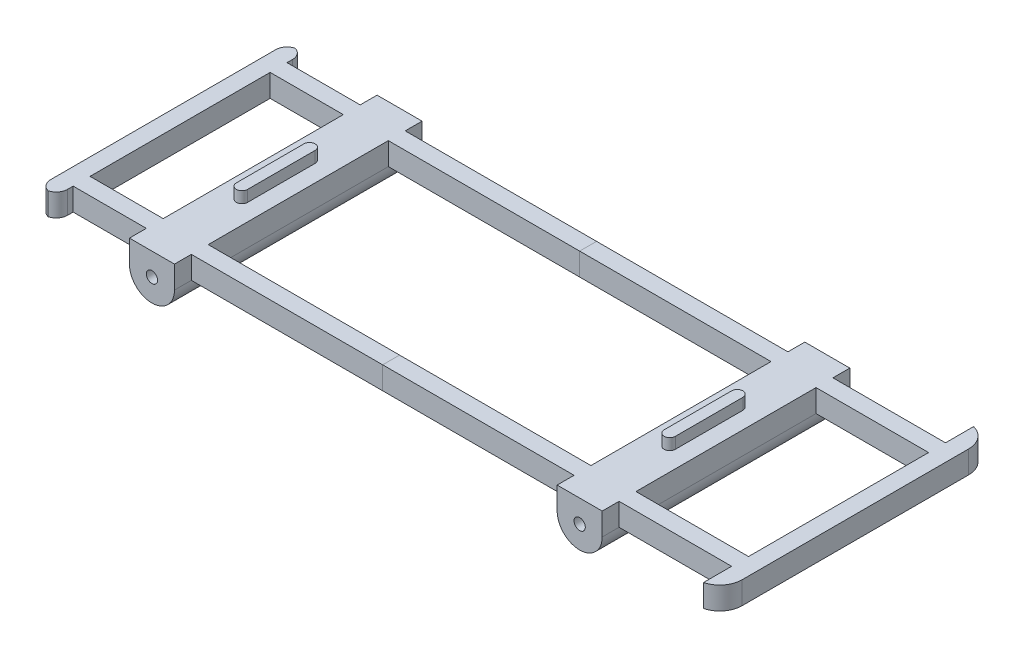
ISO-10303-21;
HEADER;
FILE_DESCRIPTION(('STEP AP214'),'2;1');
FILE_NAME('part.step','',(''),(''),'','','');
FILE_SCHEMA(('AUTOMOTIVE_DESIGN { 1 0 10303 214 1 1 1 1 }'));
ENDSEC;
DATA;
#1=APPLICATION_CONTEXT('core data for automotive mechanical design processes');
#2=APPLICATION_PROTOCOL_DEFINITION('international standard','automotive_design',2000,#1);
#3=PRODUCT_CONTEXT('',#1,'mechanical');
#4=PRODUCT('Part','Part','',(#3));
#5=PRODUCT_RELATED_PRODUCT_CATEGORY('part','',(#4));
#6=PRODUCT_DEFINITION_FORMATION('','',#4);
#7=PRODUCT_DEFINITION_CONTEXT('part definition',#1,'design');
#8=PRODUCT_DEFINITION('design','',#6,#7);
#9=PRODUCT_DEFINITION_SHAPE('','',#8);
#10=(LENGTH_UNIT() NAMED_UNIT(*) SI_UNIT(.MILLI.,.METRE.));
#11=(NAMED_UNIT(*) PLANE_ANGLE_UNIT() SI_UNIT($,.RADIAN.));
#12=(NAMED_UNIT(*) SI_UNIT($,.STERADIAN.) SOLID_ANGLE_UNIT());
#13=UNCERTAINTY_MEASURE_WITH_UNIT(LENGTH_MEASURE(1.E-05),#10,'distance_accuracy_value','');
#14=(GEOMETRIC_REPRESENTATION_CONTEXT(3) GLOBAL_UNCERTAINTY_ASSIGNED_CONTEXT((#13)) GLOBAL_UNIT_ASSIGNED_CONTEXT((#10,
#11,#12)) REPRESENTATION_CONTEXT('',''));
#15=CARTESIAN_POINT('',(0.,0.,0.));
#16=DIRECTION('',(0.,0.,1.));
#17=DIRECTION('',(1.,0.,0.));
#18=AXIS2_PLACEMENT_3D('',#15,#16,#17);
#19=CARTESIAN_POINT('',(157.656866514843,-20.01,95.));
#20=DIRECTION('',(1.,0.,0.));
#21=DIRECTION('',(0.,0.,-1.));
#22=AXIS2_PLACEMENT_3D('',#19,#20,#21);
#23=PLANE('',#22);
#24=DIRECTION('',(0.,0.,-1.));
#25=VECTOR('',#24,1.);
#26=CARTESIAN_POINT('',(157.656866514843,20.,0.));
#27=LINE('',#26,#25);
#28=CARTESIAN_POINT('',(157.656866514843,20.,95.));
#29=VERTEX_POINT('',#28);
#30=CARTESIAN_POINT('',(157.656866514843,20.,80.));
#31=VERTEX_POINT('',#30);
#32=EDGE_CURVE('E325',#29,#31,#27,.T.);
#33=ORIENTED_EDGE('',*,*,#32,.F.);
#34=DIRECTION('',(0.,-1.,0.));
#35=VECTOR('',#34,1.);
#36=CARTESIAN_POINT('',(157.656866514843,20.,95.));
#37=LINE('',#36,#35);
#38=CARTESIAN_POINT('',(157.656866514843,0.,95.));
#39=VERTEX_POINT('',#38);
#40=EDGE_CURVE('E305',#29,#39,#37,.T.);
#41=ORIENTED_EDGE('',*,*,#40,.T.);
#42=DIRECTION('',(0.,0.,-1.));
#43=VECTOR('',#42,1.);
#44=CARTESIAN_POINT('',(157.656866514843,0.,0.));
#45=LINE('',#44,#43);
#46=CARTESIAN_POINT('',(157.656866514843,0.,80.));
#47=VERTEX_POINT('',#46);
#48=EDGE_CURVE('E315',#39,#47,#45,.T.);
#49=ORIENTED_EDGE('',*,*,#48,.T.);
#50=DIRECTION('',(0.,-1.,0.));
#51=VECTOR('',#50,1.);
#52=CARTESIAN_POINT('',(157.656866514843,20.,80.));
#53=LINE('',#52,#51);
#54=EDGE_CURVE('E479',#31,#47,#53,.T.);
#55=ORIENTED_EDGE('',*,*,#54,.F.);
#56=EDGE_LOOP('',(#33,#41,#49,#55));
#57=FACE_BOUND('',#56,.T.);
#58=ADVANCED_FACE('F97',(#57),#23,.T.);
#59=CARTESIAN_POINT('',(157.656866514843,20.,-80.));
#60=VERTEX_POINT('',#59);
#61=CARTESIAN_POINT('',(157.656866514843,20.,-95.));
#62=VERTEX_POINT('',#61);
#63=EDGE_CURVE('E481',#60,#62,#27,.T.);
#64=ORIENTED_EDGE('',*,*,#63,.F.);
#65=DIRECTION('',(0.,-1.,0.));
#66=VECTOR('',#65,1.);
#67=CARTESIAN_POINT('',(157.656866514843,20.,-80.));
#68=LINE('',#67,#66);
#69=CARTESIAN_POINT('',(157.656866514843,0.,-80.));
#70=VERTEX_POINT('',#69);
#71=EDGE_CURVE('E321',#60,#70,#68,.T.);
#72=ORIENTED_EDGE('',*,*,#71,.T.);
#73=DIRECTION('',(0.,0.,-1.));
#74=VECTOR('',#73,1.);
#75=CARTESIAN_POINT('',(157.656866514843,0.,0.));
#76=LINE('',#75,#74);
#77=CARTESIAN_POINT('',(157.656866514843,0.,-95.));
#78=VERTEX_POINT('',#77);
#79=EDGE_CURVE('E320',#70,#78,#76,.T.);
#80=ORIENTED_EDGE('',*,*,#79,.T.);
#81=DIRECTION('',(0.,-1.,0.));
#82=VECTOR('',#81,1.);
#83=CARTESIAN_POINT('',(157.656866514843,20.,-95.));
#84=LINE('',#83,#82);
#85=EDGE_CURVE('E476',#62,#78,#84,.T.);
#86=ORIENTED_EDGE('',*,*,#85,.F.);
#87=EDGE_LOOP('',(#64,#72,#80,#86));
#88=FACE_BOUND('',#87,.T.);
#89=ADVANCED_FACE('F487',(#88),#23,.T.);
#90=CARTESIAN_POINT('',(-32.3431334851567,0.,-115.));
#91=DIRECTION('',(0.,0.,1.));
#92=DIRECTION('',(1.,0.,0.));
#93=AXIS2_PLACEMENT_3D('',#90,#91,#92);
#94=CYLINDRICAL_SURFACE('',#93,5.);
#95=CARTESIAN_POINT('',(-32.3431334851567,0.,110.));
#96=DIRECTION('',(0.,0.,1.));
#97=DIRECTION('',(1.,0.,0.));
#98=AXIS2_PLACEMENT_3D('',#95,#96,#97);
#99=CIRCLE('',#98,5.);
#100=CARTESIAN_POINT('',(-27.3431334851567,0.,110.));
#101=VERTEX_POINT('',#100);
#102=EDGE_CURVE('E441',#101,#101,#99,.T.);
#103=ORIENTED_EDGE('',*,*,#102,.T.);
#104=EDGE_LOOP('',(#103));
#105=FACE_BOUND('',#104,.T.);
#106=CARTESIAN_POINT('',(-32.3431334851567,0.,-110.));
#107=DIRECTION('',(0.,0.,1.));
#108=DIRECTION('',(1.,0.,0.));
#109=AXIS2_PLACEMENT_3D('',#106,#107,#108);
#110=CIRCLE('',#109,5.);
#111=CARTESIAN_POINT('',(-27.3431334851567,0.,-110.));
#112=VERTEX_POINT('',#111);
#113=EDGE_CURVE('E452',#112,#112,#110,.T.);
#114=ORIENTED_EDGE('',*,*,#113,.F.);
#115=EDGE_LOOP('',(#114));
#116=FACE_BOUND('',#115,.T.);
#117=ADVANCED_FACE('F599',(#105,#116),#94,.F.);
#118=CARTESIAN_POINT('',(-32.3431334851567,30.,30.));
#119=DIRECTION('',(0.,1.,0.));
#120=DIRECTION('',(0.,0.,1.));
#121=AXIS2_PLACEMENT_3D('',#118,#119,#120);
#122=PLANE('',#121);
#123=CARTESIAN_POINT('',(-32.3431334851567,30.,30.));
#124=DIRECTION('',(0.,1.,0.));
#125=DIRECTION('',(0.,0.,1.));
#126=AXIS2_PLACEMENT_3D('',#123,#124,#125);
#127=CIRCLE('',#126,5.);
#128=CARTESIAN_POINT('',(-37.3431334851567,30.,30.));
#129=VERTEX_POINT('',#128);
#130=CARTESIAN_POINT('',(-27.3431334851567,30.,30.));
#131=VERTEX_POINT('',#130);
#132=EDGE_CURVE('E464',#129,#131,#127,.T.);
#133=ORIENTED_EDGE('',*,*,#132,.T.);
#134=DIRECTION('',(0.,0.,-1.));
#135=VECTOR('',#134,1.);
#136=CARTESIAN_POINT('',(-27.3431334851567,30.,30.));
#137=LINE('',#136,#135);
#138=CARTESIAN_POINT('',(-27.3431334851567,30.,-30.));
#139=VERTEX_POINT('',#138);
#140=EDGE_CURVE('E132',#131,#139,#137,.T.);
#141=ORIENTED_EDGE('',*,*,#140,.T.);
#142=CARTESIAN_POINT('',(-32.3431334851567,30.,-30.));
#143=DIRECTION('',(0.,1.,0.));
#144=DIRECTION('',(0.,0.,1.));
#145=AXIS2_PLACEMENT_3D('',#142,#143,#144);
#146=CIRCLE('',#145,5.);
#147=CARTESIAN_POINT('',(-37.3431334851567,30.,-30.));
#148=VERTEX_POINT('',#147);
#149=EDGE_CURVE('E472',#139,#148,#146,.T.);
#150=ORIENTED_EDGE('',*,*,#149,.T.);
#151=DIRECTION('',(0.,0.,1.));
#152=VECTOR('',#151,1.);
#153=CARTESIAN_POINT('',(-37.3431334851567,30.,30.));
#154=LINE('',#153,#152);
#155=EDGE_CURVE('E461',#148,#129,#154,.T.);
#156=ORIENTED_EDGE('',*,*,#155,.T.);
#157=EDGE_LOOP('',(#133,#141,#150,#156));
#158=FACE_BOUND('',#157,.T.);
#159=ADVANCED_FACE('F601',(#158),#122,.T.);
#160=CARTESIAN_POINT('',(0.,0.,0.));
#161=DIRECTION('',(0.,1.,0.));
#162=DIRECTION('',(0.,0.,1.));
#163=AXIS2_PLACEMENT_3D('',#160,#161,#162);
#164=PLANE('',#163);
#165=DIRECTION('',(0.,0.,-1.));
#166=VECTOR('',#165,1.);
#167=CARTESIAN_POINT('',(-117.343133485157,0.,110.));
#168=LINE('',#167,#166);
#169=CARTESIAN_POINT('',(-117.343133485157,0.,100.));
#170=VERTEX_POINT('',#169);
#171=CARTESIAN_POINT('',(-117.343133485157,0.,95.));
#172=VERTEX_POINT('',#171);
#173=EDGE_CURVE('E377',#170,#172,#168,.T.);
#174=ORIENTED_EDGE('',*,*,#173,.F.);
#175=CARTESIAN_POINT('',(-127.343133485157,0.,100.));
#176=DIRECTION('',(0.,1.,0.));
#177=DIRECTION('',(0.,0.,1.));
#178=AXIS2_PLACEMENT_3D('',#175,#176,#177);
#179=CIRCLE('',#178,10.);
#180=CARTESIAN_POINT('',(-124.843133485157,0.,109.682458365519));
#181=VERTEX_POINT('',#180);
#182=EDGE_CURVE('E589',#170,#181,#179,.F.);
#183=ORIENTED_EDGE('',*,*,#182,.T.);
#184=CARTESIAN_POINT('',(-122.343133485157,0.,100.));
#185=DIRECTION('',(0.,1.,0.));
#186=DIRECTION('',(0.,0.,1.));
#187=AXIS2_PLACEMENT_3D('',#184,#185,#186);
#188=CIRCLE('',#187,10.);
#189=CARTESIAN_POINT('',(-132.343133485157,0.,100.));
#190=VERTEX_POINT('',#189);
#191=EDGE_CURVE('E697',#181,#190,#188,.F.);
#192=ORIENTED_EDGE('',*,*,#191,.T.);
#193=DIRECTION('',(0.,0.,-1.));
#194=VECTOR('',#193,1.);
#195=CARTESIAN_POINT('',(-132.343133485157,0.,110.));
#196=LINE('',#195,#194);
#197=CARTESIAN_POINT('',(-132.343133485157,0.,-100.));
#198=VERTEX_POINT('',#197);
#199=EDGE_CURVE('E540',#190,#198,#196,.T.);
#200=ORIENTED_EDGE('',*,*,#199,.T.);
#201=CARTESIAN_POINT('',(-122.343133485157,0.,-100.));
#202=DIRECTION('',(0.,1.,0.));
#203=DIRECTION('',(0.,0.,1.));
#204=AXIS2_PLACEMENT_3D('',#201,#202,#203);
#205=CIRCLE('',#204,10.);
#206=CARTESIAN_POINT('',(-124.843133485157,0.,-109.682458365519));
#207=VERTEX_POINT('',#206);
#208=EDGE_CURVE('E591',#198,#207,#205,.F.);
#209=ORIENTED_EDGE('',*,*,#208,.T.);
#210=CARTESIAN_POINT('',(-127.343133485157,0.,-100.));
#211=DIRECTION('',(0.,1.,0.));
#212=DIRECTION('',(0.,0.,1.));
#213=AXIS2_PLACEMENT_3D('',#210,#211,#212);
#214=CIRCLE('',#213,10.);
#215=CARTESIAN_POINT('',(-117.343133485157,0.,-100.));
#216=VERTEX_POINT('',#215);
#217=EDGE_CURVE('E562',#207,#216,#214,.F.);
#218=ORIENTED_EDGE('',*,*,#217,.T.);
#219=CARTESIAN_POINT('',(-117.343133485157,0.,-95.));
#220=VERTEX_POINT('',#219);
#221=EDGE_CURVE('E392',#220,#216,#168,.T.);
#222=ORIENTED_EDGE('',*,*,#221,.F.);
#223=DIRECTION('',(1.,0.,0.));
#224=VECTOR('',#223,1.);
#225=CARTESIAN_POINT('',(0.,0.,-95.));
#226=LINE('',#225,#224);
#227=CARTESIAN_POINT('',(-52.3431334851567,0.,-95.));
#228=VERTEX_POINT('',#227);
#229=EDGE_CURVE('E346',#220,#228,#226,.T.);
#230=ORIENTED_EDGE('',*,*,#229,.T.);
#231=DIRECTION('',(0.,0.,-1.));
#232=VECTOR('',#231,1.);
#233=CARTESIAN_POINT('',(-52.3431334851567,0.,110.));
#234=LINE('',#233,#232);
#235=CARTESIAN_POINT('',(-52.3431334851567,0.,-80.));
#236=VERTEX_POINT('',#235);
#237=EDGE_CURVE('E558',#236,#228,#234,.T.);
#238=ORIENTED_EDGE('',*,*,#237,.F.);
#239=DIRECTION('',(1.,0.,0.));
#240=VECTOR('',#239,1.);
#241=CARTESIAN_POINT('',(0.,0.,-80.));
#242=LINE('',#241,#240);
#243=CARTESIAN_POINT('',(-117.343133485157,0.,-80.));
#244=VERTEX_POINT('',#243);
#245=EDGE_CURVE('E101',#244,#236,#242,.T.);
#246=ORIENTED_EDGE('',*,*,#245,.F.);
#247=CARTESIAN_POINT('',(-117.343133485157,0.,80.));
#248=VERTEX_POINT('',#247);
#249=EDGE_CURVE('E563',#248,#244,#168,.T.);
#250=ORIENTED_EDGE('',*,*,#249,.F.);
#251=DIRECTION('',(1.,0.,0.));
#252=VECTOR('',#251,1.);
#253=CARTESIAN_POINT('',(0.,0.,80.));
#254=LINE('',#253,#252);
#255=CARTESIAN_POINT('',(-52.3431334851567,0.,80.));
#256=VERTEX_POINT('',#255);
#257=EDGE_CURVE('E310',#248,#256,#254,.T.);
#258=ORIENTED_EDGE('',*,*,#257,.T.);
#259=CARTESIAN_POINT('',(-52.3431334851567,0.,95.));
#260=VERTEX_POINT('',#259);
#261=EDGE_CURVE('E421',#260,#256,#234,.T.);
#262=ORIENTED_EDGE('',*,*,#261,.F.);
#263=DIRECTION('',(1.,0.,0.));
#264=VECTOR('',#263,1.);
#265=CARTESIAN_POINT('',(0.,0.,95.));
#266=LINE('',#265,#264);
#267=EDGE_CURVE('E311',#172,#260,#266,.T.);
#268=ORIENTED_EDGE('',*,*,#267,.F.);
#269=EDGE_LOOP('',(#174,#183,#192,#200,#209,#218,#222,#230,#238,#246,#250,#258,#262,#268));
#270=FACE_BOUND('',#269,.T.);
#271=ADVANCED_FACE('F560',(#270),#164,.F.);
#272=CARTESIAN_POINT('',(-32.3431334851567,0.,110.));
#273=DIRECTION('',(0.,0.,1.));
#274=DIRECTION('',(1.,0.,0.));
#275=AXIS2_PLACEMENT_3D('',#272,#273,#274);
#276=PLANE('',#275);
#277=ORIENTED_EDGE('',*,*,#102,.F.);
#278=EDGE_LOOP('',(#277));
#279=FACE_BOUND('',#278,.T.);
#280=DIRECTION('',(0.,1.,0.));
#281=VECTOR('',#280,1.);
#282=CARTESIAN_POINT('',(-12.3431334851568,20.,110.));
#283=LINE('',#282,#281);
#284=CARTESIAN_POINT('',(-12.3431334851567,0.,110.));
#285=VERTEX_POINT('',#284);
#286=CARTESIAN_POINT('',(-12.3431334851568,20.,110.));
#287=VERTEX_POINT('',#286);
#288=EDGE_CURVE('E432',#285,#287,#283,.T.);
#289=ORIENTED_EDGE('',*,*,#288,.T.);
#290=DIRECTION('',(-1.,0.,0.));
#291=VECTOR('',#290,1.);
#292=CARTESIAN_POINT('',(-12.3431334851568,20.,110.));
#293=LINE('',#292,#291);
#294=CARTESIAN_POINT('',(-52.3431334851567,20.,110.));
#295=VERTEX_POINT('',#294);
#296=EDGE_CURVE('E446',#287,#295,#293,.T.);
#297=ORIENTED_EDGE('',*,*,#296,.T.);
#298=DIRECTION('',(0.,-1.,0.));
#299=VECTOR('',#298,1.);
#300=CARTESIAN_POINT('',(-52.3431334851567,20.,110.));
#301=LINE('',#300,#299);
#302=CARTESIAN_POINT('',(-52.3431334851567,0.,110.));
#303=VERTEX_POINT('',#302);
#304=EDGE_CURVE('E444',#295,#303,#301,.T.);
#305=ORIENTED_EDGE('',*,*,#304,.T.);
#306=CARTESIAN_POINT('',(-32.3431334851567,0.,110.));
#307=DIRECTION('',(0.,0.,1.));
#308=DIRECTION('',(1.,0.,0.));
#309=AXIS2_PLACEMENT_3D('',#306,#307,#308);
#310=CIRCLE('',#309,20.);
#311=EDGE_CURVE('E442',#303,#285,#310,.T.);
#312=ORIENTED_EDGE('',*,*,#311,.T.);
#313=EDGE_LOOP('',(#289,#297,#305,#312));
#314=FACE_BOUND('',#313,.T.);
#315=ADVANCED_FACE('F582',(#279,#314),#276,.T.);
#316=CARTESIAN_POINT('',(-52.3431334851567,20.,110.));
#317=DIRECTION('',(1.,0.,0.));
#318=DIRECTION('',(0.,1.,0.));
#319=AXIS2_PLACEMENT_3D('',#316,#317,#318);
#320=PLANE('',#319);
#321=DIRECTION('',(0.,0.,-1.));
#322=VECTOR('',#321,1.);
#323=CARTESIAN_POINT('',(-52.3431334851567,20.,110.));
#324=LINE('',#323,#322);
#325=CARTESIAN_POINT('',(-52.3431334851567,20.,95.));
#326=VERTEX_POINT('',#325);
#327=EDGE_CURVE('E413',#295,#326,#324,.T.);
#328=ORIENTED_EDGE('',*,*,#327,.T.);
#329=DIRECTION('',(0.,-1.,0.));
#330=VECTOR('',#329,1.);
#331=CARTESIAN_POINT('',(-52.3431334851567,20.,95.));
#332=LINE('',#331,#330);
#333=EDGE_CURVE('E402',#326,#260,#332,.T.);
#334=ORIENTED_EDGE('',*,*,#333,.T.);
#335=EDGE_CURVE('E418',#303,#260,#234,.T.);
#336=ORIENTED_EDGE('',*,*,#335,.F.);
#337=ORIENTED_EDGE('',*,*,#304,.F.);
#338=EDGE_LOOP('',(#328,#334,#336,#337));
#339=FACE_BOUND('',#338,.T.);
#340=ADVANCED_FACE('F576',(#339),#320,.F.);
#341=CARTESIAN_POINT('',(0.,20.,95.));
#342=DIRECTION('',(0.,0.,-1.));
#343=DIRECTION('',(-1.,0.,0.));
#344=AXIS2_PLACEMENT_3D('',#341,#342,#343);
#345=PLANE('',#344);
#346=ORIENTED_EDGE('',*,*,#333,.F.);
#347=DIRECTION('',(1.,0.,0.));
#348=VECTOR('',#347,1.);
#349=CARTESIAN_POINT('',(0.,20.,95.));
#350=LINE('',#349,#348);
#351=CARTESIAN_POINT('',(-117.343133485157,20.,95.));
#352=VERTEX_POINT('',#351);
#353=EDGE_CURVE('E335',#352,#326,#350,.T.);
#354=ORIENTED_EDGE('',*,*,#353,.F.);
#355=DIRECTION('',(0.,-1.,0.));
#356=VECTOR('',#355,1.);
#357=CARTESIAN_POINT('',(-117.343133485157,20.,95.));
#358=LINE('',#357,#356);
#359=EDGE_CURVE('E385',#352,#172,#358,.T.);
#360=ORIENTED_EDGE('',*,*,#359,.T.);
#361=ORIENTED_EDGE('',*,*,#267,.T.);
#362=EDGE_LOOP('',(#346,#354,#360,#361));
#363=FACE_BOUND('',#362,.T.);
#364=ADVANCED_FACE('F573',(#363),#345,.F.);
#365=CARTESIAN_POINT('',(-117.343133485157,20.,110.));
#366=DIRECTION('',(-1.,0.,0.));
#367=DIRECTION('',(0.,0.,1.));
#368=AXIS2_PLACEMENT_3D('',#365,#366,#367);
#369=PLANE('',#368);
#370=DIRECTION('',(0.,0.,-1.));
#371=VECTOR('',#370,1.);
#372=CARTESIAN_POINT('',(-117.343133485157,20.,110.));
#373=LINE('',#372,#371);
#374=CARTESIAN_POINT('',(-117.343133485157,20.,100.));
#375=VERTEX_POINT('',#374);
#376=EDGE_CURVE('E367',#375,#352,#373,.T.);
#377=ORIENTED_EDGE('',*,*,#376,.F.);
#378=DIRECTION('',(0.,-1.,0.));
#379=VECTOR('',#378,1.);
#380=CARTESIAN_POINT('',(-117.343133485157,20.,100.));
#381=LINE('',#380,#379);
#382=EDGE_CURVE('E383',#375,#170,#381,.T.);
#383=ORIENTED_EDGE('',*,*,#382,.T.);
#384=ORIENTED_EDGE('',*,*,#173,.T.);
#385=ORIENTED_EDGE('',*,*,#359,.F.);
#386=EDGE_LOOP('',(#377,#383,#384,#385));
#387=FACE_BOUND('',#386,.T.);
#388=ADVANCED_FACE('F568',(#387),#369,.F.);
#389=CARTESIAN_POINT('',(-127.343133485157,20.,100.));
#390=DIRECTION('',(0.,-1.,0.));
#391=DIRECTION('',(0.,0.,-1.));
#392=AXIS2_PLACEMENT_3D('',#389,#390,#391);
#393=CYLINDRICAL_SURFACE('',#392,10.);
#394=CARTESIAN_POINT('',(-127.343133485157,20.,100.));
#395=DIRECTION('',(0.,1.,0.));
#396=DIRECTION('',(0.,0.,1.));
#397=AXIS2_PLACEMENT_3D('',#394,#395,#396);
#398=CIRCLE('',#397,10.);
#399=CARTESIAN_POINT('',(-124.843133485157,20.,109.682458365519));
#400=VERTEX_POINT('',#399);
#401=EDGE_CURVE('E585',#400,#375,#398,.T.);
#402=ORIENTED_EDGE('',*,*,#401,.F.);
#403=DIRECTION('',(0.,1.,0.));
#404=VECTOR('',#403,1.);
#405=CARTESIAN_POINT('',(-124.843133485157,10.,109.682458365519));
#406=LINE('',#405,#404);
#407=EDGE_CURVE('E107',#400,#181,#406,.F.);
#408=ORIENTED_EDGE('',*,*,#407,.T.);
#409=ORIENTED_EDGE('',*,*,#182,.F.);
#410=ORIENTED_EDGE('',*,*,#382,.F.);
#411=EDGE_LOOP('',(#402,#408,#409,#410));
#412=FACE_BOUND('',#411,.T.);
#413=ADVANCED_FACE('F587',(#412),#393,.T.);
#414=CARTESIAN_POINT('',(-122.343133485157,20.,100.));
#415=DIRECTION('',(0.,1.,0.));
#416=DIRECTION('',(0.,0.,1.));
#417=AXIS2_PLACEMENT_3D('',#414,#415,#416);
#418=CYLINDRICAL_SURFACE('',#417,10.);
#419=ORIENTED_EDGE('',*,*,#407,.F.);
#420=CARTESIAN_POINT('',(-122.343133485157,20.,100.));
#421=DIRECTION('',(0.,1.,0.));
#422=DIRECTION('',(0.,0.,1.));
#423=AXIS2_PLACEMENT_3D('',#420,#421,#422);
#424=CIRCLE('',#423,10.);
#425=CARTESIAN_POINT('',(-132.343133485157,20.,100.));
#426=VERTEX_POINT('',#425);
#427=EDGE_CURVE('E698',#426,#400,#424,.T.);
#428=ORIENTED_EDGE('',*,*,#427,.F.);
#429=DIRECTION('',(0.,-1.,0.));
#430=VECTOR('',#429,1.);
#431=CARTESIAN_POINT('',(-132.343133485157,20.,100.));
#432=LINE('',#431,#430);
#433=EDGE_CURVE('E692',#190,#426,#432,.F.);
#434=ORIENTED_EDGE('',*,*,#433,.F.);
#435=ORIENTED_EDGE('',*,*,#191,.F.);
#436=EDGE_LOOP('',(#419,#428,#434,#435));
#437=FACE_BOUND('',#436,.T.);
#438=ADVANCED_FACE('F681',(#437),#418,.T.);
#439=CARTESIAN_POINT('',(-132.343133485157,20.,110.));
#440=DIRECTION('',(-1.,0.,0.));
#441=DIRECTION('',(0.,0.,1.));
#442=AXIS2_PLACEMENT_3D('',#439,#440,#441);
#443=PLANE('',#442);
#444=ORIENTED_EDGE('',*,*,#199,.F.);
#445=ORIENTED_EDGE('',*,*,#433,.T.);
#446=DIRECTION('',(0.,0.,-1.));
#447=VECTOR('',#446,1.);
#448=CARTESIAN_POINT('',(-132.343133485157,20.,110.));
#449=LINE('',#448,#447);
#450=CARTESIAN_POINT('',(-132.343133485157,20.,-100.));
#451=VERTEX_POINT('',#450);
#452=EDGE_CURVE('E360',#426,#451,#449,.T.);
#453=ORIENTED_EDGE('',*,*,#452,.T.);
#454=DIRECTION('',(0.,-1.,0.));
#455=VECTOR('',#454,1.);
#456=CARTESIAN_POINT('',(-132.343133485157,20.,-100.));
#457=LINE('',#456,#455);
#458=EDGE_CURVE('E693',#451,#198,#457,.T.);
#459=ORIENTED_EDGE('',*,*,#458,.T.);
#460=EDGE_LOOP('',(#444,#445,#453,#459));
#461=FACE_BOUND('',#460,.T.);
#462=ADVANCED_FACE('F679',(#461),#443,.T.);
#463=CARTESIAN_POINT('',(-122.343133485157,20.,-100.));
#464=DIRECTION('',(0.,-1.,0.));
#465=DIRECTION('',(0.,0.,-1.));
#466=AXIS2_PLACEMENT_3D('',#463,#464,#465);
#467=CYLINDRICAL_SURFACE('',#466,10.);
#468=CARTESIAN_POINT('',(-122.343133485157,20.,-100.));
#469=DIRECTION('',(0.,1.,0.));
#470=DIRECTION('',(0.,0.,1.));
#471=AXIS2_PLACEMENT_3D('',#468,#469,#470);
#472=CIRCLE('',#471,10.);
#473=CARTESIAN_POINT('',(-124.843133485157,20.,-109.682458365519));
#474=VERTEX_POINT('',#473);
#475=EDGE_CURVE('E706',#474,#451,#472,.T.);
#476=ORIENTED_EDGE('',*,*,#475,.F.);
#477=DIRECTION('',(0.,1.,0.));
#478=VECTOR('',#477,1.);
#479=CARTESIAN_POINT('',(-124.843133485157,10.,-109.682458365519));
#480=LINE('',#479,#478);
#481=EDGE_CURVE('E13',#474,#207,#480,.F.);
#482=ORIENTED_EDGE('',*,*,#481,.T.);
#483=ORIENTED_EDGE('',*,*,#208,.F.);
#484=ORIENTED_EDGE('',*,*,#458,.F.);
#485=EDGE_LOOP('',(#476,#482,#483,#484));
#486=FACE_BOUND('',#485,.T.);
#487=ADVANCED_FACE('F663',(#486),#467,.T.);
#488=CARTESIAN_POINT('',(-127.343133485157,20.,-100.));
#489=DIRECTION('',(0.,1.,0.));
#490=DIRECTION('',(0.,0.,1.));
#491=AXIS2_PLACEMENT_3D('',#488,#489,#490);
#492=CYLINDRICAL_SURFACE('',#491,10.);
#493=ORIENTED_EDGE('',*,*,#481,.F.);
#494=CARTESIAN_POINT('',(-127.343133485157,20.,-100.));
#495=DIRECTION('',(0.,1.,0.));
#496=DIRECTION('',(0.,0.,1.));
#497=AXIS2_PLACEMENT_3D('',#494,#495,#496);
#498=CIRCLE('',#497,10.);
#499=CARTESIAN_POINT('',(-117.343133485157,20.,-100.));
#500=VERTEX_POINT('',#499);
#501=EDGE_CURVE('E708',#500,#474,#498,.T.);
#502=ORIENTED_EDGE('',*,*,#501,.F.);
#503=DIRECTION('',(0.,-1.,0.));
#504=VECTOR('',#503,1.);
#505=CARTESIAN_POINT('',(-117.343133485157,20.,-100.));
#506=LINE('',#505,#504);
#507=EDGE_CURVE('E478',#216,#500,#506,.F.);
#508=ORIENTED_EDGE('',*,*,#507,.F.);
#509=ORIENTED_EDGE('',*,*,#217,.F.);
#510=EDGE_LOOP('',(#493,#502,#508,#509));
#511=FACE_BOUND('',#510,.T.);
#512=ADVANCED_FACE('F659',(#511),#492,.T.);
#513=ORIENTED_EDGE('',*,*,#221,.T.);
#514=ORIENTED_EDGE('',*,*,#507,.T.);
#515=CARTESIAN_POINT('',(-117.343133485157,20.,-95.));
#516=VERTEX_POINT('',#515);
#517=EDGE_CURVE('E375',#516,#500,#373,.T.);
#518=ORIENTED_EDGE('',*,*,#517,.F.);
#519=DIRECTION('',(0.,-1.,0.));
#520=VECTOR('',#519,1.);
#521=CARTESIAN_POINT('',(-117.343133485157,20.,-95.));
#522=LINE('',#521,#520);
#523=EDGE_CURVE('E334',#516,#220,#522,.T.);
#524=ORIENTED_EDGE('',*,*,#523,.T.);
#525=EDGE_LOOP('',(#513,#514,#518,#524));
#526=FACE_BOUND('',#525,.T.);
#527=ADVANCED_FACE('F537',(#526),#369,.F.);
#528=CARTESIAN_POINT('',(0.,20.,-95.));
#529=DIRECTION('',(0.,0.,-1.));
#530=DIRECTION('',(-1.,0.,0.));
#531=AXIS2_PLACEMENT_3D('',#528,#529,#530);
#532=PLANE('',#531);
#533=DIRECTION('',(1.,0.,0.));
#534=VECTOR('',#533,1.);
#535=CARTESIAN_POINT('',(0.,20.,-95.));
#536=LINE('',#535,#534);
#537=CARTESIAN_POINT('',(-52.3431334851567,20.,-95.));
#538=VERTEX_POINT('',#537);
#539=EDGE_CURVE('E330',#516,#538,#536,.T.);
#540=ORIENTED_EDGE('',*,*,#539,.T.);
#541=DIRECTION('',(0.,-1.,0.));
#542=VECTOR('',#541,1.);
#543=CARTESIAN_POINT('',(-52.3431334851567,20.,-95.));
#544=LINE('',#543,#542);
#545=EDGE_CURVE('E405',#538,#228,#544,.T.);
#546=ORIENTED_EDGE('',*,*,#545,.T.);
#547=ORIENTED_EDGE('',*,*,#229,.F.);
#548=ORIENTED_EDGE('',*,*,#523,.F.);
#549=EDGE_LOOP('',(#540,#546,#547,#548));
#550=FACE_BOUND('',#549,.T.);
#551=ADVANCED_FACE('F99',(#550),#532,.T.);
#552=ORIENTED_EDGE('',*,*,#545,.F.);
#553=CARTESIAN_POINT('',(-52.3431334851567,20.,-110.));
#554=VERTEX_POINT('',#553);
#555=EDGE_CURVE('E417',#538,#554,#324,.T.);
#556=ORIENTED_EDGE('',*,*,#555,.T.);
#557=DIRECTION('',(0.,-1.,0.));
#558=VECTOR('',#557,1.);
#559=CARTESIAN_POINT('',(-52.3431334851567,20.,-110.));
#560=LINE('',#559,#558);
#561=CARTESIAN_POINT('',(-52.3431334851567,0.,-110.));
#562=VERTEX_POINT('',#561);
#563=EDGE_CURVE('E431',#554,#562,#560,.T.);
#564=ORIENTED_EDGE('',*,*,#563,.T.);
#565=EDGE_CURVE('E422',#228,#562,#234,.T.);
#566=ORIENTED_EDGE('',*,*,#565,.F.);
#567=EDGE_LOOP('',(#552,#556,#564,#566));
#568=FACE_BOUND('',#567,.T.);
#569=ADVANCED_FACE('F646',(#568),#320,.F.);
#570=CARTESIAN_POINT('',(-32.3431334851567,0.,-110.));
#571=DIRECTION('',(0.,0.,1.));
#572=DIRECTION('',(1.,0.,0.));
#573=AXIS2_PLACEMENT_3D('',#570,#571,#572);
#574=PLANE('',#573);
#575=ORIENTED_EDGE('',*,*,#113,.T.);
#576=EDGE_LOOP('',(#575));
#577=FACE_BOUND('',#576,.T.);
#578=DIRECTION('',(0.,1.,0.));
#579=VECTOR('',#578,1.);
#580=CARTESIAN_POINT('',(-12.3431334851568,20.,-110.));
#581=LINE('',#580,#579);
#582=CARTESIAN_POINT('',(-12.3431334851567,0.,-110.));
#583=VERTEX_POINT('',#582);
#584=CARTESIAN_POINT('',(-12.3431334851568,20.,-110.));
#585=VERTEX_POINT('',#584);
#586=EDGE_CURVE('E438',#583,#585,#581,.T.);
#587=ORIENTED_EDGE('',*,*,#586,.F.);
#588=CARTESIAN_POINT('',(-32.3431334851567,0.,-110.));
#589=DIRECTION('',(0.,0.,1.));
#590=DIRECTION('',(1.,0.,0.));
#591=AXIS2_PLACEMENT_3D('',#588,#589,#590);
#592=CIRCLE('',#591,20.);
#593=EDGE_CURVE('E428',#562,#583,#592,.T.);
#594=ORIENTED_EDGE('',*,*,#593,.F.);
#595=ORIENTED_EDGE('',*,*,#563,.F.);
#596=DIRECTION('',(-1.,0.,0.));
#597=VECTOR('',#596,1.);
#598=CARTESIAN_POINT('',(-12.3431334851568,20.,-110.));
#599=LINE('',#598,#597);
#600=EDGE_CURVE('E435',#585,#554,#599,.T.);
#601=ORIENTED_EDGE('',*,*,#600,.F.);
#602=EDGE_LOOP('',(#587,#594,#595,#601));
#603=FACE_BOUND('',#602,.T.);
#604=ADVANCED_FACE('F526',(#577,#603),#574,.F.);
#605=ORIENTED_EDGE('',*,*,#249,.T.);
#606=DIRECTION('',(0.,-1.,0.));
#607=VECTOR('',#606,1.);
#608=CARTESIAN_POINT('',(-117.343133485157,20.,-80.));
#609=LINE('',#608,#607);
#610=CARTESIAN_POINT('',(-117.343133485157,20.,-80.));
#611=VERTEX_POINT('',#610);
#612=EDGE_CURVE('E380',#611,#244,#609,.T.);
#613=ORIENTED_EDGE('',*,*,#612,.F.);
#614=CARTESIAN_POINT('',(-117.343133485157,20.,80.));
#615=VERTEX_POINT('',#614);
#616=EDGE_CURVE('E373',#615,#611,#373,.T.);
#617=ORIENTED_EDGE('',*,*,#616,.F.);
#618=DIRECTION('',(0.,-1.,0.));
#619=VECTOR('',#618,1.);
#620=CARTESIAN_POINT('',(-117.343133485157,20.,80.));
#621=LINE('',#620,#619);
#622=EDGE_CURVE('E382',#615,#248,#621,.T.);
#623=ORIENTED_EDGE('',*,*,#622,.T.);
#624=EDGE_LOOP('',(#605,#613,#617,#623));
#625=FACE_BOUND('',#624,.T.);
#626=ADVANCED_FACE('F637',(#625),#369,.F.);
#627=CARTESIAN_POINT('',(0.,20.,80.));
#628=DIRECTION('',(0.,0.,-1.));
#629=DIRECTION('',(-1.,0.,0.));
#630=AXIS2_PLACEMENT_3D('',#627,#628,#629);
#631=PLANE('',#630);
#632=DIRECTION('',(1.,0.,0.));
#633=VECTOR('',#632,1.);
#634=CARTESIAN_POINT('',(0.,20.,80.));
#635=LINE('',#634,#633);
#636=CARTESIAN_POINT('',(-52.3431334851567,20.,80.));
#637=VERTEX_POINT('',#636);
#638=EDGE_CURVE('E339',#615,#637,#635,.T.);
#639=ORIENTED_EDGE('',*,*,#638,.T.);
#640=DIRECTION('',(0.,-1.,0.));
#641=VECTOR('',#640,1.);
#642=CARTESIAN_POINT('',(-52.3431334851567,20.,80.));
#643=LINE('',#642,#641);
#644=EDGE_CURVE('E400',#637,#256,#643,.T.);
#645=ORIENTED_EDGE('',*,*,#644,.T.);
#646=ORIENTED_EDGE('',*,*,#257,.F.);
#647=ORIENTED_EDGE('',*,*,#622,.F.);
#648=EDGE_LOOP('',(#639,#645,#646,#647));
#649=FACE_BOUND('',#648,.T.);
#650=ADVANCED_FACE('F635',(#649),#631,.T.);
#651=CARTESIAN_POINT('',(-52.3431334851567,20.,-80.));
#652=VERTEX_POINT('',#651);
#653=EDGE_CURVE('E416',#637,#652,#324,.T.);
#654=ORIENTED_EDGE('',*,*,#653,.T.);
#655=DIRECTION('',(0.,-1.,0.));
#656=VECTOR('',#655,1.);
#657=CARTESIAN_POINT('',(-52.3431334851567,20.,-80.));
#658=LINE('',#657,#656);
#659=EDGE_CURVE('E398',#652,#236,#658,.T.);
#660=ORIENTED_EDGE('',*,*,#659,.T.);
#661=EDGE_CURVE('E555',#256,#236,#234,.T.);
#662=ORIENTED_EDGE('',*,*,#661,.F.);
#663=ORIENTED_EDGE('',*,*,#644,.F.);
#664=EDGE_LOOP('',(#654,#660,#662,#663));
#665=FACE_BOUND('',#664,.T.);
#666=ADVANCED_FACE('F553',(#665),#320,.F.);
#667=CARTESIAN_POINT('',(0.,20.,-80.));
#668=DIRECTION('',(0.,0.,-1.));
#669=DIRECTION('',(-1.,0.,0.));
#670=AXIS2_PLACEMENT_3D('',#667,#668,#669);
#671=PLANE('',#670);
#672=ORIENTED_EDGE('',*,*,#659,.F.);
#673=DIRECTION('',(1.,0.,0.));
#674=VECTOR('',#673,1.);
#675=CARTESIAN_POINT('',(0.,20.,-80.));
#676=LINE('',#675,#674);
#677=EDGE_CURVE('E342',#611,#652,#676,.T.);
#678=ORIENTED_EDGE('',*,*,#677,.F.);
#679=ORIENTED_EDGE('',*,*,#612,.T.);
#680=ORIENTED_EDGE('',*,*,#245,.T.);
#681=EDGE_LOOP('',(#672,#678,#679,#680));
#682=FACE_BOUND('',#681,.T.);
#683=ADVANCED_FACE('F549',(#682),#671,.F.);
#684=CARTESIAN_POINT('',(-32.3431334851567,30.,-30.));
#685=DIRECTION('',(0.,-1.,0.));
#686=DIRECTION('',(0.,0.,-1.));
#687=AXIS2_PLACEMENT_3D('',#684,#685,#686);
#688=CYLINDRICAL_SURFACE('',#687,5.);
#689=CARTESIAN_POINT('',(-32.3431334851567,20.,-30.));
#690=DIRECTION('',(0.,1.,0.));
#691=DIRECTION('',(0.,0.,1.));
#692=AXIS2_PLACEMENT_3D('',#689,#690,#691);
#693=CIRCLE('',#692,5.);
#694=CARTESIAN_POINT('',(-27.3431334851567,20.,-30.));
#695=VERTEX_POINT('',#694);
#696=CARTESIAN_POINT('',(-37.3431334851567,20.,-30.));
#697=VERTEX_POINT('',#696);
#698=EDGE_CURVE('E463',#695,#697,#693,.T.);
#699=ORIENTED_EDGE('',*,*,#698,.T.);
#700=DIRECTION('',(0.,-1.,0.));
#701=VECTOR('',#700,1.);
#702=CARTESIAN_POINT('',(-37.3431334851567,30.,-30.));
#703=LINE('',#702,#701);
#704=EDGE_CURVE('E457',#148,#697,#703,.T.);
#705=ORIENTED_EDGE('',*,*,#704,.F.);
#706=ORIENTED_EDGE('',*,*,#149,.F.);
#707=DIRECTION('',(0.,-1.,0.));
#708=VECTOR('',#707,1.);
#709=CARTESIAN_POINT('',(-27.3431334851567,30.,-30.));
#710=LINE('',#709,#708);
#711=EDGE_CURVE('E454',#139,#695,#710,.T.);
#712=ORIENTED_EDGE('',*,*,#711,.T.);
#713=EDGE_LOOP('',(#699,#705,#706,#712));
#714=FACE_BOUND('',#713,.T.);
#715=ADVANCED_FACE('F621',(#714),#688,.T.);
#716=CARTESIAN_POINT('',(-37.3431334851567,30.,30.));
#717=DIRECTION('',(1.,0.,0.));
#718=DIRECTION('',(0.,0.,-1.));
#719=AXIS2_PLACEMENT_3D('',#716,#717,#718);
#720=PLANE('',#719);
#721=DIRECTION('',(0.,0.,1.));
#722=VECTOR('',#721,1.);
#723=CARTESIAN_POINT('',(-37.3431334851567,20.,30.));
#724=LINE('',#723,#722);
#725=CARTESIAN_POINT('',(-37.3431334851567,20.,30.));
#726=VERTEX_POINT('',#725);
#727=EDGE_CURVE('E139',#697,#726,#724,.T.);
#728=ORIENTED_EDGE('',*,*,#727,.T.);
#729=DIRECTION('',(0.,-1.,0.));
#730=VECTOR('',#729,1.);
#731=CARTESIAN_POINT('',(-37.3431334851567,30.,30.));
#732=LINE('',#731,#730);
#733=EDGE_CURVE('E459',#129,#726,#732,.T.);
#734=ORIENTED_EDGE('',*,*,#733,.F.);
#735=ORIENTED_EDGE('',*,*,#155,.F.);
#736=ORIENTED_EDGE('',*,*,#704,.T.);
#737=EDGE_LOOP('',(#728,#734,#735,#736));
#738=FACE_BOUND('',#737,.T.);
#739=ADVANCED_FACE('F617',(#738),#720,.F.);
#740=CARTESIAN_POINT('',(-32.3431334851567,30.,30.));
#741=DIRECTION('',(0.,-1.,0.));
#742=DIRECTION('',(0.,0.,-1.));
#743=AXIS2_PLACEMENT_3D('',#740,#741,#742);
#744=CYLINDRICAL_SURFACE('',#743,5.);
#745=CARTESIAN_POINT('',(-32.3431334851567,20.,30.));
#746=DIRECTION('',(0.,1.,0.));
#747=DIRECTION('',(0.,0.,1.));
#748=AXIS2_PLACEMENT_3D('',#745,#746,#747);
#749=CIRCLE('',#748,5.);
#750=CARTESIAN_POINT('',(-27.3431334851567,20.,30.));
#751=VERTEX_POINT('',#750);
#752=EDGE_CURVE('E469',#726,#751,#749,.T.);
#753=ORIENTED_EDGE('',*,*,#752,.T.);
#754=DIRECTION('',(0.,-1.,0.));
#755=VECTOR('',#754,1.);
#756=CARTESIAN_POINT('',(-27.3431334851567,30.,30.));
#757=LINE('',#756,#755);
#758=EDGE_CURVE('E116',#131,#751,#757,.T.);
#759=ORIENTED_EDGE('',*,*,#758,.F.);
#760=ORIENTED_EDGE('',*,*,#132,.F.);
#761=ORIENTED_EDGE('',*,*,#733,.T.);
#762=EDGE_LOOP('',(#753,#759,#760,#761));
#763=FACE_BOUND('',#762,.T.);
#764=ADVANCED_FACE('F613',(#763),#744,.T.);
#765=CARTESIAN_POINT('',(-27.3431334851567,30.,30.));
#766=DIRECTION('',(-1.,0.,0.));
#767=DIRECTION('',(0.,0.,1.));
#768=AXIS2_PLACEMENT_3D('',#765,#766,#767);
#769=PLANE('',#768);
#770=DIRECTION('',(0.,0.,-1.));
#771=VECTOR('',#770,1.);
#772=CARTESIAN_POINT('',(-27.3431334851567,20.,30.));
#773=LINE('',#772,#771);
#774=EDGE_CURVE('E467',#751,#695,#773,.T.);
#775=ORIENTED_EDGE('',*,*,#774,.T.);
#776=ORIENTED_EDGE('',*,*,#711,.F.);
#777=ORIENTED_EDGE('',*,*,#140,.F.);
#778=ORIENTED_EDGE('',*,*,#758,.T.);
#779=EDGE_LOOP('',(#775,#776,#777,#778));
#780=FACE_BOUND('',#779,.T.);
#781=ADVANCED_FACE('F616',(#780),#769,.F.);
#782=CARTESIAN_POINT('',(-32.3431334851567,0.,110.));
#783=DIRECTION('',(0.,0.,-1.));
#784=DIRECTION('',(-1.,0.,0.));
#785=AXIS2_PLACEMENT_3D('',#782,#783,#784);
#786=CYLINDRICAL_SURFACE('',#785,20.);
#787=ORIENTED_EDGE('',*,*,#593,.T.);
#788=DIRECTION('',(0.,0.,-1.));
#789=VECTOR('',#788,1.);
#790=CARTESIAN_POINT('',(-12.3431334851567,0.,110.));
#791=LINE('',#790,#789);
#792=CARTESIAN_POINT('',(-12.3431334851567,0.,-95.));
#793=VERTEX_POINT('',#792);
#794=EDGE_CURVE('E427',#793,#583,#791,.T.);
#795=ORIENTED_EDGE('',*,*,#794,.F.);
#796=CARTESIAN_POINT('',(-12.3431334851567,0.,-80.));
#797=VERTEX_POINT('',#796);
#798=EDGE_CURVE('E493',#797,#793,#791,.T.);
#799=ORIENTED_EDGE('',*,*,#798,.F.);
#800=CARTESIAN_POINT('',(-12.3431334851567,0.,80.));
#801=VERTEX_POINT('',#800);
#802=EDGE_CURVE('E510',#801,#797,#791,.T.);
#803=ORIENTED_EDGE('',*,*,#802,.F.);
#804=CARTESIAN_POINT('',(-12.3431334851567,0.,95.));
#805=VERTEX_POINT('',#804);
#806=EDGE_CURVE('E426',#805,#801,#791,.T.);
#807=ORIENTED_EDGE('',*,*,#806,.F.);
#808=EDGE_CURVE('E423',#285,#805,#791,.T.);
#809=ORIENTED_EDGE('',*,*,#808,.F.);
#810=ORIENTED_EDGE('',*,*,#311,.F.);
#811=ORIENTED_EDGE('',*,*,#335,.T.);
#812=ORIENTED_EDGE('',*,*,#261,.T.);
#813=ORIENTED_EDGE('',*,*,#661,.T.);
#814=ORIENTED_EDGE('',*,*,#237,.T.);
#815=ORIENTED_EDGE('',*,*,#565,.T.);
#816=EDGE_LOOP('',(#787,#795,#799,#803,#807,#809,#810,#811,#812,#813,#814,#815));
#817=FACE_BOUND('',#816,.T.);
#818=ADVANCED_FACE('F516',(#817),#786,.T.);
#819=CARTESIAN_POINT('',(-12.3431334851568,20.,110.));
#820=DIRECTION('',(-1.,0.,0.));
#821=DIRECTION('',(0.,-1.,0.));
#822=AXIS2_PLACEMENT_3D('',#819,#820,#821);
#823=PLANE('',#822);
#824=ORIENTED_EDGE('',*,*,#802,.T.);
#825=DIRECTION('',(0.,1.,0.));
#826=VECTOR('',#825,1.);
#827=CARTESIAN_POINT('',(-12.3431334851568,20.,-80.));
#828=LINE('',#827,#826);
#829=CARTESIAN_POINT('',(-12.3431334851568,20.,-80.));
#830=VERTEX_POINT('',#829);
#831=EDGE_CURVE('E389',#797,#830,#828,.T.);
#832=ORIENTED_EDGE('',*,*,#831,.T.);
#833=DIRECTION('',(0.,0.,-1.));
#834=VECTOR('',#833,1.);
#835=CARTESIAN_POINT('',(-12.3431334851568,20.,110.));
#836=LINE('',#835,#834);
#837=CARTESIAN_POINT('',(-12.3431334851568,20.,80.));
#838=VERTEX_POINT('',#837);
#839=EDGE_CURVE('E411',#838,#830,#836,.T.);
#840=ORIENTED_EDGE('',*,*,#839,.F.);
#841=DIRECTION('',(0.,1.,0.));
#842=VECTOR('',#841,1.);
#843=CARTESIAN_POINT('',(-12.3431334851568,20.,80.));
#844=LINE('',#843,#842);
#845=EDGE_CURVE('E391',#801,#838,#844,.T.);
#846=ORIENTED_EDGE('',*,*,#845,.F.);
#847=EDGE_LOOP('',(#824,#832,#840,#846));
#848=FACE_BOUND('',#847,.T.);
#849=ADVANCED_FACE('F507',(#848),#823,.F.);
#850=ORIENTED_EDGE('',*,*,#48,.F.);
#851=EDGE_CURVE('E301',#805,#39,#266,.T.);
#852=ORIENTED_EDGE('',*,*,#851,.F.);
#853=ORIENTED_EDGE('',*,*,#806,.T.);
#854=EDGE_CURVE('E318',#801,#47,#254,.T.);
#855=ORIENTED_EDGE('',*,*,#854,.T.);
#856=EDGE_LOOP('',(#850,#852,#853,#855));
#857=FACE_BOUND('',#856,.T.);
#858=ADVANCED_FACE('F316',(#857),#164,.F.);
#859=ORIENTED_EDGE('',*,*,#808,.T.);
#860=DIRECTION('',(0.,1.,0.));
#861=VECTOR('',#860,1.);
#862=CARTESIAN_POINT('',(-12.3431334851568,20.,95.));
#863=LINE('',#862,#861);
#864=CARTESIAN_POINT('',(-12.3431334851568,20.,95.));
#865=VERTEX_POINT('',#864);
#866=EDGE_CURVE('E307',#805,#865,#863,.T.);
#867=ORIENTED_EDGE('',*,*,#866,.T.);
#868=EDGE_CURVE('E408',#287,#865,#836,.T.);
#869=ORIENTED_EDGE('',*,*,#868,.F.);
#870=ORIENTED_EDGE('',*,*,#288,.F.);
#871=EDGE_LOOP('',(#859,#867,#869,#870));
#872=FACE_BOUND('',#871,.T.);
#873=ADVANCED_FACE('F678',(#872),#823,.F.);
#874=DIRECTION('',(0.,1.,0.));
#875=VECTOR('',#874,1.);
#876=CARTESIAN_POINT('',(-12.3431334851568,20.,-95.));
#877=LINE('',#876,#875);
#878=CARTESIAN_POINT('',(-12.3431334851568,20.,-95.));
#879=VERTEX_POINT('',#878);
#880=EDGE_CURVE('E395',#793,#879,#877,.T.);
#881=ORIENTED_EDGE('',*,*,#880,.F.);
#882=ORIENTED_EDGE('',*,*,#794,.T.);
#883=ORIENTED_EDGE('',*,*,#586,.T.);
#884=EDGE_CURVE('E412',#879,#585,#836,.T.);
#885=ORIENTED_EDGE('',*,*,#884,.F.);
#886=EDGE_LOOP('',(#881,#882,#883,#885));
#887=FACE_BOUND('',#886,.T.);
#888=ADVANCED_FACE('F520',(#887),#823,.F.);
#889=ORIENTED_EDGE('',*,*,#79,.F.);
#890=EDGE_CURVE('E356',#797,#70,#242,.T.);
#891=ORIENTED_EDGE('',*,*,#890,.F.);
#892=ORIENTED_EDGE('',*,*,#798,.T.);
#893=EDGE_CURVE('E348',#793,#78,#226,.T.);
#894=ORIENTED_EDGE('',*,*,#893,.T.);
#895=EDGE_LOOP('',(#889,#891,#892,#894));
#896=FACE_BOUND('',#895,.T.);
#897=ADVANCED_FACE('F492',(#896),#164,.F.);
#898=CARTESIAN_POINT('',(0.,20.,0.));
#899=DIRECTION('',(0.,1.,0.));
#900=DIRECTION('',(0.,0.,1.));
#901=AXIS2_PLACEMENT_3D('',#898,#899,#900);
#902=PLANE('',#901);
#903=ORIENTED_EDGE('',*,*,#774,.F.);
#904=ORIENTED_EDGE('',*,*,#752,.F.);
#905=ORIENTED_EDGE('',*,*,#727,.F.);
#906=ORIENTED_EDGE('',*,*,#698,.F.);
#907=EDGE_LOOP('',(#903,#904,#905,#906));
#908=FACE_BOUND('',#907,.T.);
#909=ORIENTED_EDGE('',*,*,#677,.T.);
#910=ORIENTED_EDGE('',*,*,#653,.F.);
#911=ORIENTED_EDGE('',*,*,#638,.F.);
#912=ORIENTED_EDGE('',*,*,#616,.T.);
#913=EDGE_LOOP('',(#909,#910,#911,#912));
#914=FACE_BOUND('',#913,.T.);
#915=EDGE_CURVE('E338',#865,#29,#350,.T.);
#916=ORIENTED_EDGE('',*,*,#915,.T.);
#917=ORIENTED_EDGE('',*,*,#32,.T.);
#918=EDGE_CURVE('E341',#838,#31,#635,.T.);
#919=ORIENTED_EDGE('',*,*,#918,.F.);
#920=ORIENTED_EDGE('',*,*,#839,.T.);
#921=EDGE_CURVE('E345',#830,#60,#676,.T.);
#922=ORIENTED_EDGE('',*,*,#921,.T.);
#923=ORIENTED_EDGE('',*,*,#63,.T.);
#924=EDGE_CURVE('E333',#879,#62,#536,.T.);
#925=ORIENTED_EDGE('',*,*,#924,.F.);
#926=ORIENTED_EDGE('',*,*,#884,.T.);
#927=ORIENTED_EDGE('',*,*,#600,.T.);
#928=ORIENTED_EDGE('',*,*,#555,.F.);
#929=ORIENTED_EDGE('',*,*,#539,.F.);
#930=ORIENTED_EDGE('',*,*,#517,.T.);
#931=ORIENTED_EDGE('',*,*,#501,.T.);
#932=ORIENTED_EDGE('',*,*,#475,.T.);
#933=ORIENTED_EDGE('',*,*,#452,.F.);
#934=ORIENTED_EDGE('',*,*,#427,.T.);
#935=ORIENTED_EDGE('',*,*,#401,.T.);
#936=ORIENTED_EDGE('',*,*,#376,.T.);
#937=ORIENTED_EDGE('',*,*,#353,.T.);
#938=ORIENTED_EDGE('',*,*,#327,.F.);
#939=ORIENTED_EDGE('',*,*,#296,.F.);
#940=ORIENTED_EDGE('',*,*,#868,.T.);
#941=EDGE_LOOP('',(#916,#917,#919,#920,#922,#923,#925,#926,#927,#928,#929,#930,#931,#932,#933,
#934,#935,#936,#937,#938,#939,#940));
#942=FACE_BOUND('',#941,.T.);
#943=ADVANCED_FACE('F499',(#908,#914,#942),#902,.T.);
#944=ORIENTED_EDGE('',*,*,#924,.T.);
#945=ORIENTED_EDGE('',*,*,#85,.T.);
#946=ORIENTED_EDGE('',*,*,#893,.F.);
#947=ORIENTED_EDGE('',*,*,#880,.T.);
#948=EDGE_LOOP('',(#944,#945,#946,#947));
#949=FACE_BOUND('',#948,.T.);
#950=ADVANCED_FACE('F496',(#949),#532,.T.);
#951=ORIENTED_EDGE('',*,*,#40,.F.);
#952=ORIENTED_EDGE('',*,*,#915,.F.);
#953=ORIENTED_EDGE('',*,*,#866,.F.);
#954=ORIENTED_EDGE('',*,*,#851,.T.);
#955=EDGE_LOOP('',(#951,#952,#953,#954));
#956=FACE_BOUND('',#955,.T.);
#957=ADVANCED_FACE('F303',(#956),#345,.F.);
#958=ORIENTED_EDGE('',*,*,#918,.T.);
#959=ORIENTED_EDGE('',*,*,#54,.T.);
#960=ORIENTED_EDGE('',*,*,#854,.F.);
#961=ORIENTED_EDGE('',*,*,#845,.T.);
#962=EDGE_LOOP('',(#958,#959,#960,#961));
#963=FACE_BOUND('',#962,.T.);
#964=ADVANCED_FACE('F514',(#963),#631,.T.);
#965=ORIENTED_EDGE('',*,*,#71,.F.);
#966=ORIENTED_EDGE('',*,*,#921,.F.);
#967=ORIENTED_EDGE('',*,*,#831,.F.);
#968=ORIENTED_EDGE('',*,*,#890,.T.);
#969=EDGE_LOOP('',(#965,#966,#967,#968));
#970=FACE_BOUND('',#969,.T.);
#971=ADVANCED_FACE('F503',(#970),#671,.F.);
#972=CLOSED_SHELL('',(#58,#89,#117,#159,#271,#315,#340,#364,#388,#413,#438,#462,#487,#512,#527,
#551,#569,#604,#626,#650,#666,#683,#715,#739,#764,#781,#818,#849,#858,#873,#888,#897,#943,#950,
#957,#964,#971));
#973=MANIFOLD_SOLID_BREP('B2',#972);
#974=CARTESIAN_POINT('',(157.656866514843,-20.01,95.));
#975=DIRECTION('',(1.,0.,0.));
#976=DIRECTION('',(0.,0.,-1.));
#977=AXIS2_PLACEMENT_3D('',#974,#975,#976);
#978=PLANE('',#977);
#979=DIRECTION('',(0.,0.,-1.));
#980=VECTOR('',#979,1.);
#981=CARTESIAN_POINT('',(157.656866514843,20.,0.));
#982=LINE('',#981,#980);
#983=CARTESIAN_POINT('',(157.656866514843,20.,95.));
#984=VERTEX_POINT('',#983);
#985=CARTESIAN_POINT('',(157.656866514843,20.,80.));
#986=VERTEX_POINT('',#985);
#987=EDGE_CURVE('E1330',#984,#986,#982,.T.);
#988=ORIENTED_EDGE('',*,*,#987,.T.);
#989=DIRECTION('',(0.,-1.,0.));
#990=VECTOR('',#989,1.);
#991=CARTESIAN_POINT('',(157.656866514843,20.,80.));
#992=LINE('',#991,#990);
#993=CARTESIAN_POINT('',(157.656866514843,0.,80.));
#994=VERTEX_POINT('',#993);
#995=EDGE_CURVE('E976',#986,#994,#992,.T.);
#996=ORIENTED_EDGE('',*,*,#995,.T.);
#997=DIRECTION('',(0.,0.,-1.));
#998=VECTOR('',#997,1.);
#999=CARTESIAN_POINT('',(157.656866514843,0.,0.));
#1000=LINE('',#999,#998);
#1001=CARTESIAN_POINT('',(157.656866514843,0.,95.));
#1002=VERTEX_POINT('',#1001);
#1003=EDGE_CURVE('E1328',#1002,#994,#1000,.T.);
#1004=ORIENTED_EDGE('',*,*,#1003,.F.);
#1005=DIRECTION('',(0.,-1.,0.));
#1006=VECTOR('',#1005,1.);
#1007=CARTESIAN_POINT('',(157.656866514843,20.,95.));
#1008=LINE('',#1007,#1006);
#1009=EDGE_CURVE('E1321',#984,#1002,#1008,.T.);
#1010=ORIENTED_EDGE('',*,*,#1009,.F.);
#1011=EDGE_LOOP('',(#988,#996,#1004,#1010));
#1012=FACE_BOUND('',#1011,.T.);
#1013=ADVANCED_FACE('F968',(#1012),#978,.F.);
#1014=CARTESIAN_POINT('',(157.656866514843,20.,-80.));
#1015=VERTEX_POINT('',#1014);
#1016=CARTESIAN_POINT('',(157.656866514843,20.,-95.));
#1017=VERTEX_POINT('',#1016);
#1018=EDGE_CURVE('E1327',#1015,#1017,#982,.T.);
#1019=ORIENTED_EDGE('',*,*,#1018,.T.);
#1020=DIRECTION('',(0.,-1.,0.));
#1021=VECTOR('',#1020,1.);
#1022=CARTESIAN_POINT('',(157.656866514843,20.,-95.));
#1023=LINE('',#1022,#1021);
#1024=CARTESIAN_POINT('',(157.656866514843,0.,-95.));
#1025=VERTEX_POINT('',#1024);
#1026=EDGE_CURVE('E95',#1017,#1025,#1023,.T.);
#1027=ORIENTED_EDGE('',*,*,#1026,.T.);
#1028=DIRECTION('',(0.,0.,-1.));
#1029=VECTOR('',#1028,1.);
#1030=CARTESIAN_POINT('',(157.656866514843,0.,0.));
#1031=LINE('',#1030,#1029);
#1032=CARTESIAN_POINT('',(157.656866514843,0.,-80.));
#1033=VERTEX_POINT('',#1032);
#1034=EDGE_CURVE('E971',#1033,#1025,#1031,.T.);
#1035=ORIENTED_EDGE('',*,*,#1034,.F.);
#1036=DIRECTION('',(0.,-1.,0.));
#1037=VECTOR('',#1036,1.);
#1038=CARTESIAN_POINT('',(157.656866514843,20.,-80.));
#1039=LINE('',#1038,#1037);
#1040=EDGE_CURVE('E1324',#1015,#1033,#1039,.T.);
#1041=ORIENTED_EDGE('',*,*,#1040,.F.);
#1042=EDGE_LOOP('',(#1019,#1027,#1035,#1041));
#1043=FACE_BOUND('',#1042,.T.);
#1044=ADVANCED_FACE('F1338',(#1043),#978,.F.);
#1045=CARTESIAN_POINT('',(0.,20.,0.));
#1046=DIRECTION('',(0.,1.,0.));
#1047=DIRECTION('',(0.,0.,1.));
#1048=AXIS2_PLACEMENT_3D('',#1045,#1046,#1047);
#1049=PLANE('',#1048);
#1050=ORIENTED_EDGE('',*,*,#987,.F.);
#1051=DIRECTION('',(1.,0.,0.));
#1052=VECTOR('',#1051,1.);
#1053=CARTESIAN_POINT('',(0.,20.,95.));
#1054=LINE('',#1053,#1052);
#1055=CARTESIAN_POINT('',(327.656866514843,20.,95.));
#1056=VERTEX_POINT('',#1055);
#1057=EDGE_CURVE('E1264',#984,#1056,#1054,.T.);
#1058=ORIENTED_EDGE('',*,*,#1057,.T.);
#1059=DIRECTION('',(0.,0.,-1.));
#1060=VECTOR('',#1059,1.);
#1061=CARTESIAN_POINT('',(327.656866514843,20.,110.));
#1062=LINE('',#1061,#1060);
#1063=CARTESIAN_POINT('',(327.656866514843,20.,110.));
#1064=VERTEX_POINT('',#1063);
#1065=EDGE_CURVE('E1220',#1064,#1056,#1062,.T.);
#1066=ORIENTED_EDGE('',*,*,#1065,.F.);
#1067=DIRECTION('',(-1.,0.,0.));
#1068=VECTOR('',#1067,1.);
#1069=CARTESIAN_POINT('',(367.656866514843,20.,110.));
#1070=LINE('',#1069,#1068);
#1071=CARTESIAN_POINT('',(367.656866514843,20.,110.));
#1072=VERTEX_POINT('',#1071);
#1073=EDGE_CURVE('E1192',#1072,#1064,#1070,.T.);
#1074=ORIENTED_EDGE('',*,*,#1073,.F.);
#1075=DIRECTION('',(0.,0.,-1.));
#1076=VECTOR('',#1075,1.);
#1077=CARTESIAN_POINT('',(367.656866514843,20.,110.));
#1078=LINE('',#1077,#1076);
#1079=CARTESIAN_POINT('',(367.656866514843,20.,95.));
#1080=VERTEX_POINT('',#1079);
#1081=EDGE_CURVE('E1225',#1072,#1080,#1078,.T.);
#1082=ORIENTED_EDGE('',*,*,#1081,.T.);
#1083=CARTESIAN_POINT('',(467.656866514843,20.,95.));
#1084=VERTEX_POINT('',#1083);
#1085=EDGE_CURVE('E1263',#1080,#1084,#1054,.T.);
#1086=ORIENTED_EDGE('',*,*,#1085,.T.);
#1087=DIRECTION('',(0.,0.,1.));
#1088=VECTOR('',#1087,1.);
#1089=CARTESIAN_POINT('',(467.656866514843,20.,0.));
#1090=LINE('',#1089,#1088);
#1091=CARTESIAN_POINT('',(467.656866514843,20.,120.));
#1092=VERTEX_POINT('',#1091);
#1093=EDGE_CURVE('E1260',#1084,#1092,#1090,.T.);
#1094=ORIENTED_EDGE('',*,*,#1093,.T.);
#1095=CARTESIAN_POINT('',(462.656866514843,20.,100.635083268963));
#1096=DIRECTION('',(0.,1.,0.));
#1097=DIRECTION('',(0.,0.,1.));
#1098=AXIS2_PLACEMENT_3D('',#1095,#1096,#1097);
#1099=CIRCLE('',#1098,20.);
#1100=CARTESIAN_POINT('',(482.656866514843,20.,100.635083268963));
#1101=VERTEX_POINT('',#1100);
#1102=EDGE_CURVE('E1320',#1092,#1101,#1099,.T.);
#1103=ORIENTED_EDGE('',*,*,#1102,.T.);
#1104=DIRECTION('',(0.,0.,1.));
#1105=VECTOR('',#1104,1.);
#1106=CARTESIAN_POINT('',(482.656866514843,20.,0.));
#1107=LINE('',#1106,#1105);
#1108=CARTESIAN_POINT('',(482.656866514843,20.,-100.635083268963));
#1109=VERTEX_POINT('',#1108);
#1110=EDGE_CURVE('E1266',#1109,#1101,#1107,.T.);
#1111=ORIENTED_EDGE('',*,*,#1110,.F.);
#1112=CARTESIAN_POINT('',(462.656866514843,20.,-100.635083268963));
#1113=DIRECTION('',(0.,1.,0.));
#1114=DIRECTION('',(0.,0.,1.));
#1115=AXIS2_PLACEMENT_3D('',#1112,#1113,#1114);
#1116=CIRCLE('',#1115,20.);
#1117=CARTESIAN_POINT('',(467.656866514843,20.,-120.));
#1118=VERTEX_POINT('',#1117);
#1119=EDGE_CURVE('E1318',#1109,#1118,#1116,.T.);
#1120=ORIENTED_EDGE('',*,*,#1119,.T.);
#1121=CARTESIAN_POINT('',(467.656866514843,20.,-95.));
#1122=VERTEX_POINT('',#1121);
#1123=EDGE_CURVE('E1259',#1118,#1122,#1090,.T.);
#1124=ORIENTED_EDGE('',*,*,#1123,.T.);
#1125=DIRECTION('',(1.,0.,0.));
#1126=VECTOR('',#1125,1.);
#1127=CARTESIAN_POINT('',(0.,20.,-95.));
#1128=LINE('',#1127,#1126);
#1129=CARTESIAN_POINT('',(367.656866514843,20.,-95.));
#1130=VERTEX_POINT('',#1129);
#1131=EDGE_CURVE('E1272',#1130,#1122,#1128,.T.);
#1132=ORIENTED_EDGE('',*,*,#1131,.F.);
#1133=CARTESIAN_POINT('',(367.656866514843,20.,-110.));
#1134=VERTEX_POINT('',#1133);
#1135=EDGE_CURVE('E1223',#1130,#1134,#1078,.T.);
#1136=ORIENTED_EDGE('',*,*,#1135,.T.);
#1137=DIRECTION('',(-1.,0.,0.));
#1138=VECTOR('',#1137,1.);
#1139=CARTESIAN_POINT('',(367.656866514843,20.,-110.));
#1140=LINE('',#1139,#1138);
#1141=CARTESIAN_POINT('',(327.656866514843,20.,-110.));
#1142=VERTEX_POINT('',#1141);
#1143=EDGE_CURVE('E1202',#1134,#1142,#1140,.T.);
#1144=ORIENTED_EDGE('',*,*,#1143,.T.);
#1145=CARTESIAN_POINT('',(327.656866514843,20.,-95.));
#1146=VERTEX_POINT('',#1145);
#1147=EDGE_CURVE('E1218',#1146,#1142,#1062,.T.);
#1148=ORIENTED_EDGE('',*,*,#1147,.F.);
#1149=EDGE_CURVE('E1269',#1017,#1146,#1128,.T.);
#1150=ORIENTED_EDGE('',*,*,#1149,.F.);
#1151=ORIENTED_EDGE('',*,*,#1018,.F.);
#1152=DIRECTION('',(1.,0.,0.));
#1153=VECTOR('',#1152,1.);
#1154=CARTESIAN_POINT('',(0.,20.,-80.));
#1155=LINE('',#1154,#1153);
#1156=CARTESIAN_POINT('',(327.656866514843,20.,-80.));
#1157=VERTEX_POINT('',#1156);
#1158=EDGE_CURVE('E1252',#1015,#1157,#1155,.T.);
#1159=ORIENTED_EDGE('',*,*,#1158,.T.);
#1160=CARTESIAN_POINT('',(327.656866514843,20.,80.));
#1161=VERTEX_POINT('',#1160);
#1162=EDGE_CURVE('E1224',#1161,#1157,#1062,.T.);
#1163=ORIENTED_EDGE('',*,*,#1162,.F.);
#1164=DIRECTION('',(1.,0.,0.));
#1165=VECTOR('',#1164,1.);
#1166=CARTESIAN_POINT('',(0.,20.,80.));
#1167=LINE('',#1166,#1165);
#1168=EDGE_CURVE('E1261',#986,#1161,#1167,.T.);
#1169=ORIENTED_EDGE('',*,*,#1168,.F.);
#1170=EDGE_LOOP('',(#1050,#1058,#1066,#1074,#1082,#1086,#1094,#1103,#1111,#1120,#1124,#1132,
#1136,#1144,#1148,#1150,#1151,#1159,#1163,#1169));
#1171=FACE_BOUND('',#1170,.T.);
#1172=CARTESIAN_POINT('',(367.656866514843,20.,80.));
#1173=VERTEX_POINT('',#1172);
#1174=CARTESIAN_POINT('',(367.656866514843,20.,-80.));
#1175=VERTEX_POINT('',#1174);
#1176=EDGE_CURVE('E1229',#1173,#1175,#1078,.T.);
#1177=ORIENTED_EDGE('',*,*,#1176,.T.);
#1178=CARTESIAN_POINT('',(467.656866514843,20.,-80.));
#1179=VERTEX_POINT('',#1178);
#1180=EDGE_CURVE('E1255',#1175,#1179,#1155,.T.);
#1181=ORIENTED_EDGE('',*,*,#1180,.T.);
#1182=CARTESIAN_POINT('',(467.656866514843,20.,80.));
#1183=VERTEX_POINT('',#1182);
#1184=EDGE_CURVE('E1254',#1179,#1183,#1090,.T.);
#1185=ORIENTED_EDGE('',*,*,#1184,.T.);
#1186=EDGE_CURVE('E1258',#1173,#1183,#1167,.T.);
#1187=ORIENTED_EDGE('',*,*,#1186,.F.);
#1188=EDGE_LOOP('',(#1177,#1181,#1185,#1187));
#1189=FACE_BOUND('',#1188,.T.);
#1190=DIRECTION('',(0.,0.,-1.));
#1191=VECTOR('',#1190,1.);
#1192=CARTESIAN_POINT('',(352.656866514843,20.,30.));
#1193=LINE('',#1192,#1191);
#1194=CARTESIAN_POINT('',(352.656866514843,20.,30.));
#1195=VERTEX_POINT('',#1194);
#1196=CARTESIAN_POINT('',(352.656866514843,20.,-30.));
#1197=VERTEX_POINT('',#1196);
#1198=EDGE_CURVE('E1794',#1195,#1197,#1193,.T.);
#1199=ORIENTED_EDGE('',*,*,#1198,.F.);
#1200=CARTESIAN_POINT('',(347.656866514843,20.,30.));
#1201=DIRECTION('',(0.,1.,0.));
#1202=DIRECTION('',(0.,0.,1.));
#1203=AXIS2_PLACEMENT_3D('',#1200,#1201,#1202);
#1204=CIRCLE('',#1203,5.);
#1205=CARTESIAN_POINT('',(342.656866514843,20.,30.));
#1206=VERTEX_POINT('',#1205);
#1207=EDGE_CURVE('E1175',#1206,#1195,#1204,.T.);
#1208=ORIENTED_EDGE('',*,*,#1207,.F.);
#1209=DIRECTION('',(0.,0.,1.));
#1210=VECTOR('',#1209,1.);
#1211=CARTESIAN_POINT('',(342.656866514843,20.,30.));
#1212=LINE('',#1211,#1210);
#1213=CARTESIAN_POINT('',(342.656866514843,20.,-30.));
#1214=VERTEX_POINT('',#1213);
#1215=EDGE_CURVE('E1171',#1214,#1206,#1212,.T.);
#1216=ORIENTED_EDGE('',*,*,#1215,.F.);
#1217=CARTESIAN_POINT('',(347.656866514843,20.,-30.));
#1218=DIRECTION('',(0.,1.,0.));
#1219=DIRECTION('',(0.,0.,1.));
#1220=AXIS2_PLACEMENT_3D('',#1217,#1218,#1219);
#1221=CIRCLE('',#1220,5.);
#1222=EDGE_CURVE('E1791',#1197,#1214,#1221,.T.);
#1223=ORIENTED_EDGE('',*,*,#1222,.F.);
#1224=EDGE_LOOP('',(#1199,#1208,#1216,#1223));
#1225=FACE_BOUND('',#1224,.T.);
#1226=ADVANCED_FACE('F1376',(#1171,#1189,#1225),#1049,.T.);
#1227=CARTESIAN_POINT('',(0.,0.,0.));
#1228=DIRECTION('',(0.,1.,0.));
#1229=DIRECTION('',(0.,0.,1.));
#1230=AXIS2_PLACEMENT_3D('',#1227,#1228,#1229);
#1231=PLANE('',#1230);
#1232=DIRECTION('',(1.,0.,0.));
#1233=VECTOR('',#1232,1.);
#1234=CARTESIAN_POINT('',(0.,0.,-80.));
#1235=LINE('',#1234,#1233);
#1236=CARTESIAN_POINT('',(327.656866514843,0.,-80.));
#1237=VERTEX_POINT('',#1236);
#1238=EDGE_CURVE('E1273',#1033,#1237,#1235,.T.);
#1239=ORIENTED_EDGE('',*,*,#1238,.F.);
#1240=ORIENTED_EDGE('',*,*,#1034,.T.);
#1241=DIRECTION('',(1.,0.,0.));
#1242=VECTOR('',#1241,1.);
#1243=CARTESIAN_POINT('',(0.,0.,-95.));
#1244=LINE('',#1243,#1242);
#1245=CARTESIAN_POINT('',(327.656866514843,0.,-95.));
#1246=VERTEX_POINT('',#1245);
#1247=EDGE_CURVE('E1289',#1025,#1246,#1244,.T.);
#1248=ORIENTED_EDGE('',*,*,#1247,.T.);
#1249=DIRECTION('',(0.,0.,-1.));
#1250=VECTOR('',#1249,1.);
#1251=CARTESIAN_POINT('',(327.656866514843,0.,110.));
#1252=LINE('',#1251,#1250);
#1253=EDGE_CURVE('E1341',#1237,#1246,#1252,.T.);
#1254=ORIENTED_EDGE('',*,*,#1253,.F.);
#1255=EDGE_LOOP('',(#1239,#1240,#1248,#1254));
#1256=FACE_BOUND('',#1255,.T.);
#1257=ADVANCED_FACE('F1339',(#1256),#1231,.F.);
#1258=DIRECTION('',(1.,0.,0.));
#1259=VECTOR('',#1258,1.);
#1260=CARTESIAN_POINT('',(0.,0.,95.));
#1261=LINE('',#1260,#1259);
#1262=CARTESIAN_POINT('',(327.656866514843,0.,95.));
#1263=VERTEX_POINT('',#1262);
#1264=EDGE_CURVE('E1284',#1002,#1263,#1261,.T.);
#1265=ORIENTED_EDGE('',*,*,#1264,.F.);
#1266=ORIENTED_EDGE('',*,*,#1003,.T.);
#1267=DIRECTION('',(1.,0.,0.));
#1268=VECTOR('',#1267,1.);
#1269=CARTESIAN_POINT('',(0.,0.,80.));
#1270=LINE('',#1269,#1268);
#1271=CARTESIAN_POINT('',(327.656866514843,0.,80.));
#1272=VERTEX_POINT('',#1271);
#1273=EDGE_CURVE('E1281',#994,#1272,#1270,.T.);
#1274=ORIENTED_EDGE('',*,*,#1273,.T.);
#1275=EDGE_CURVE('E1219',#1263,#1272,#1252,.T.);
#1276=ORIENTED_EDGE('',*,*,#1275,.F.);
#1277=EDGE_LOOP('',(#1265,#1266,#1274,#1276));
#1278=FACE_BOUND('',#1277,.T.);
#1279=ADVANCED_FACE('F1358',(#1278),#1231,.F.);
#1280=CARTESIAN_POINT('',(0.,20.,-80.));
#1281=DIRECTION('',(0.,0.,-1.));
#1282=DIRECTION('',(-1.,0.,0.));
#1283=AXIS2_PLACEMENT_3D('',#1280,#1281,#1282);
#1284=PLANE('',#1283);
#1285=ORIENTED_EDGE('',*,*,#1158,.F.);
#1286=ORIENTED_EDGE('',*,*,#1040,.T.);
#1287=ORIENTED_EDGE('',*,*,#1238,.T.);
#1288=DIRECTION('',(0.,-1.,0.));
#1289=VECTOR('',#1288,1.);
#1290=CARTESIAN_POINT('',(327.656866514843,20.,-80.));
#1291=LINE('',#1290,#1289);
#1292=EDGE_CURVE('E1238',#1157,#1237,#1291,.T.);
#1293=ORIENTED_EDGE('',*,*,#1292,.F.);
#1294=EDGE_LOOP('',(#1285,#1286,#1287,#1293));
#1295=FACE_BOUND('',#1294,.T.);
#1296=ADVANCED_FACE('F1333',(#1295),#1284,.F.);
#1297=CARTESIAN_POINT('',(0.,20.,80.));
#1298=DIRECTION('',(0.,0.,-1.));
#1299=DIRECTION('',(-1.,0.,0.));
#1300=AXIS2_PLACEMENT_3D('',#1297,#1298,#1299);
#1301=PLANE('',#1300);
#1302=ORIENTED_EDGE('',*,*,#995,.F.);
#1303=ORIENTED_EDGE('',*,*,#1168,.T.);
#1304=DIRECTION('',(0.,-1.,0.));
#1305=VECTOR('',#1304,1.);
#1306=CARTESIAN_POINT('',(327.656866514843,20.,80.));
#1307=LINE('',#1306,#1305);
#1308=EDGE_CURVE('E1235',#1161,#1272,#1307,.T.);
#1309=ORIENTED_EDGE('',*,*,#1308,.T.);
#1310=ORIENTED_EDGE('',*,*,#1273,.F.);
#1311=EDGE_LOOP('',(#1302,#1303,#1309,#1310));
#1312=FACE_BOUND('',#1311,.T.);
#1313=ADVANCED_FACE('F1374',(#1312),#1301,.T.);
#1314=CARTESIAN_POINT('',(0.,20.,95.));
#1315=DIRECTION('',(0.,0.,-1.));
#1316=DIRECTION('',(-1.,0.,0.));
#1317=AXIS2_PLACEMENT_3D('',#1314,#1315,#1316);
#1318=PLANE('',#1317);
#1319=ORIENTED_EDGE('',*,*,#1057,.F.);
#1320=ORIENTED_EDGE('',*,*,#1009,.T.);
#1321=ORIENTED_EDGE('',*,*,#1264,.T.);
#1322=DIRECTION('',(0.,-1.,0.));
#1323=VECTOR('',#1322,1.);
#1324=CARTESIAN_POINT('',(327.656866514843,20.,95.));
#1325=LINE('',#1324,#1323);
#1326=EDGE_CURVE('E1232',#1056,#1263,#1325,.T.);
#1327=ORIENTED_EDGE('',*,*,#1326,.F.);
#1328=EDGE_LOOP('',(#1319,#1320,#1321,#1327));
#1329=FACE_BOUND('',#1328,.T.);
#1330=ADVANCED_FACE('F1367',(#1329),#1318,.F.);
#1331=CARTESIAN_POINT('',(0.,20.,-95.));
#1332=DIRECTION('',(0.,0.,-1.));
#1333=DIRECTION('',(-1.,0.,0.));
#1334=AXIS2_PLACEMENT_3D('',#1331,#1332,#1333);
#1335=PLANE('',#1334);
#1336=ORIENTED_EDGE('',*,*,#1026,.F.);
#1337=ORIENTED_EDGE('',*,*,#1149,.T.);
#1338=DIRECTION('',(0.,-1.,0.));
#1339=VECTOR('',#1338,1.);
#1340=CARTESIAN_POINT('',(327.656866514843,20.,-95.));
#1341=LINE('',#1340,#1339);
#1342=EDGE_CURVE('E1228',#1146,#1246,#1341,.T.);
#1343=ORIENTED_EDGE('',*,*,#1342,.T.);
#1344=ORIENTED_EDGE('',*,*,#1247,.F.);
#1345=EDGE_LOOP('',(#1336,#1337,#1343,#1344));
#1346=FACE_BOUND('',#1345,.T.);
#1347=ADVANCED_FACE('F1427',(#1346),#1335,.T.);
#1348=DIRECTION('',(0.,1.,0.));
#1349=VECTOR('',#1348,1.);
#1350=CARTESIAN_POINT('',(367.656866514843,20.,-80.));
#1351=LINE('',#1350,#1349);
#1352=CARTESIAN_POINT('',(367.656866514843,0.,-80.));
#1353=VERTEX_POINT('',#1352);
#1354=EDGE_CURVE('E1248',#1353,#1175,#1351,.T.);
#1355=ORIENTED_EDGE('',*,*,#1354,.F.);
#1356=CARTESIAN_POINT('',(467.656866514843,0.,-80.));
#1357=VERTEX_POINT('',#1356);
#1358=EDGE_CURVE('E1251',#1353,#1357,#1235,.T.);
#1359=ORIENTED_EDGE('',*,*,#1358,.T.);
#1360=DIRECTION('',(0.,-1.,0.));
#1361=VECTOR('',#1360,1.);
#1362=CARTESIAN_POINT('',(467.656866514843,20.,-80.));
#1363=LINE('',#1362,#1361);
#1364=EDGE_CURVE('E1306',#1179,#1357,#1363,.T.);
#1365=ORIENTED_EDGE('',*,*,#1364,.F.);
#1366=ORIENTED_EDGE('',*,*,#1180,.F.);
#1367=EDGE_LOOP('',(#1355,#1359,#1365,#1366));
#1368=FACE_BOUND('',#1367,.T.);
#1369=ADVANCED_FACE('F1425',(#1368),#1284,.F.);
#1370=CARTESIAN_POINT('',(367.656866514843,0.,80.));
#1371=VERTEX_POINT('',#1370);
#1372=CARTESIAN_POINT('',(467.656866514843,0.,80.));
#1373=VERTEX_POINT('',#1372);
#1374=EDGE_CURVE('E1278',#1371,#1373,#1270,.T.);
#1375=ORIENTED_EDGE('',*,*,#1374,.F.);
#1376=DIRECTION('',(0.,1.,0.));
#1377=VECTOR('',#1376,1.);
#1378=CARTESIAN_POINT('',(367.656866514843,20.,80.));
#1379=LINE('',#1378,#1377);
#1380=EDGE_CURVE('E1246',#1371,#1173,#1379,.T.);
#1381=ORIENTED_EDGE('',*,*,#1380,.T.);
#1382=ORIENTED_EDGE('',*,*,#1186,.T.);
#1383=DIRECTION('',(0.,-1.,0.));
#1384=VECTOR('',#1383,1.);
#1385=CARTESIAN_POINT('',(467.656866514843,20.,80.));
#1386=LINE('',#1385,#1384);
#1387=EDGE_CURVE('E1303',#1183,#1373,#1386,.T.);
#1388=ORIENTED_EDGE('',*,*,#1387,.T.);
#1389=EDGE_LOOP('',(#1375,#1381,#1382,#1388));
#1390=FACE_BOUND('',#1389,.T.);
#1391=ADVANCED_FACE('F1413',(#1390),#1301,.T.);
#1392=DIRECTION('',(0.,1.,0.));
#1393=VECTOR('',#1392,1.);
#1394=CARTESIAN_POINT('',(367.656866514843,20.,95.));
#1395=LINE('',#1394,#1393);
#1396=CARTESIAN_POINT('',(367.656866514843,0.,95.));
#1397=VERTEX_POINT('',#1396);
#1398=EDGE_CURVE('E1243',#1397,#1080,#1395,.T.);
#1399=ORIENTED_EDGE('',*,*,#1398,.F.);
#1400=CARTESIAN_POINT('',(467.656866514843,0.,95.));
#1401=VERTEX_POINT('',#1400);
#1402=EDGE_CURVE('E1283',#1397,#1401,#1261,.T.);
#1403=ORIENTED_EDGE('',*,*,#1402,.T.);
#1404=DIRECTION('',(0.,-1.,0.));
#1405=VECTOR('',#1404,1.);
#1406=CARTESIAN_POINT('',(467.656866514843,20.,95.));
#1407=LINE('',#1406,#1405);
#1408=EDGE_CURVE('E1300',#1084,#1401,#1407,.T.);
#1409=ORIENTED_EDGE('',*,*,#1408,.F.);
#1410=ORIENTED_EDGE('',*,*,#1085,.F.);
#1411=EDGE_LOOP('',(#1399,#1403,#1409,#1410));
#1412=FACE_BOUND('',#1411,.T.);
#1413=ADVANCED_FACE('F1433',(#1412),#1318,.F.);
#1414=CARTESIAN_POINT('',(367.656866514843,0.,-95.));
#1415=VERTEX_POINT('',#1414);
#1416=CARTESIAN_POINT('',(467.656866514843,0.,-95.));
#1417=VERTEX_POINT('',#1416);
#1418=EDGE_CURVE('E1291',#1415,#1417,#1244,.T.);
#1419=ORIENTED_EDGE('',*,*,#1418,.F.);
#1420=DIRECTION('',(0.,1.,0.));
#1421=VECTOR('',#1420,1.);
#1422=CARTESIAN_POINT('',(367.656866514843,20.,-95.));
#1423=LINE('',#1422,#1421);
#1424=EDGE_CURVE('E1241',#1415,#1130,#1423,.T.);
#1425=ORIENTED_EDGE('',*,*,#1424,.T.);
#1426=ORIENTED_EDGE('',*,*,#1131,.T.);
#1427=DIRECTION('',(0.,-1.,0.));
#1428=VECTOR('',#1427,1.);
#1429=CARTESIAN_POINT('',(467.656866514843,20.,-95.));
#1430=LINE('',#1429,#1428);
#1431=EDGE_CURVE('E1271',#1122,#1417,#1430,.T.);
#1432=ORIENTED_EDGE('',*,*,#1431,.T.);
#1433=EDGE_LOOP('',(#1419,#1425,#1426,#1432));
#1434=FACE_BOUND('',#1433,.T.);
#1435=ADVANCED_FACE('F1436',(#1434),#1335,.T.);
#1436=DIRECTION('',(0.,0.,1.));
#1437=VECTOR('',#1436,1.);
#1438=CARTESIAN_POINT('',(482.656866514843,0.,0.));
#1439=LINE('',#1438,#1437);
#1440=CARTESIAN_POINT('',(482.656866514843,0.,-100.635083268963));
#1441=VERTEX_POINT('',#1440);
#1442=CARTESIAN_POINT('',(482.656866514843,0.,100.635083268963));
#1443=VERTEX_POINT('',#1442);
#1444=EDGE_CURVE('E1286',#1441,#1443,#1439,.T.);
#1445=ORIENTED_EDGE('',*,*,#1444,.T.);
#1446=CARTESIAN_POINT('',(462.656866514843,0.,100.635083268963));
#1447=DIRECTION('',(0.,1.,0.));
#1448=DIRECTION('',(0.,0.,1.));
#1449=AXIS2_PLACEMENT_3D('',#1446,#1447,#1448);
#1450=CIRCLE('',#1449,20.);
#1451=CARTESIAN_POINT('',(467.656866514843,0.,120.));
#1452=VERTEX_POINT('',#1451);
#1453=EDGE_CURVE('E1316',#1443,#1452,#1450,.F.);
#1454=ORIENTED_EDGE('',*,*,#1453,.T.);
#1455=DIRECTION('',(0.,0.,1.));
#1456=VECTOR('',#1455,1.);
#1457=CARTESIAN_POINT('',(467.656866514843,0.,0.));
#1458=LINE('',#1457,#1456);
#1459=EDGE_CURVE('E1280',#1401,#1452,#1458,.T.);
#1460=ORIENTED_EDGE('',*,*,#1459,.F.);
#1461=ORIENTED_EDGE('',*,*,#1402,.F.);
#1462=DIRECTION('',(0.,0.,-1.));
#1463=VECTOR('',#1462,1.);
#1464=CARTESIAN_POINT('',(367.656866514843,0.,110.));
#1465=LINE('',#1464,#1463);
#1466=EDGE_CURVE('E1214',#1397,#1371,#1465,.T.);
#1467=ORIENTED_EDGE('',*,*,#1466,.T.);
#1468=ORIENTED_EDGE('',*,*,#1374,.T.);
#1469=EDGE_CURVE('E1275',#1357,#1373,#1458,.T.);
#1470=ORIENTED_EDGE('',*,*,#1469,.F.);
#1471=ORIENTED_EDGE('',*,*,#1358,.F.);
#1472=EDGE_CURVE('E1395',#1353,#1415,#1465,.T.);
#1473=ORIENTED_EDGE('',*,*,#1472,.T.);
#1474=ORIENTED_EDGE('',*,*,#1418,.T.);
#1475=CARTESIAN_POINT('',(467.656866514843,0.,-120.));
#1476=VERTEX_POINT('',#1475);
#1477=EDGE_CURVE('E1279',#1476,#1417,#1458,.T.);
#1478=ORIENTED_EDGE('',*,*,#1477,.F.);
#1479=CARTESIAN_POINT('',(462.656866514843,0.,-100.635083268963));
#1480=DIRECTION('',(0.,1.,0.));
#1481=DIRECTION('',(0.,0.,1.));
#1482=AXIS2_PLACEMENT_3D('',#1479,#1480,#1481);
#1483=CIRCLE('',#1482,20.);
#1484=EDGE_CURVE('E1314',#1476,#1441,#1483,.F.);
#1485=ORIENTED_EDGE('',*,*,#1484,.T.);
#1486=EDGE_LOOP('',(#1445,#1454,#1460,#1461,#1467,#1468,#1470,#1471,#1473,#1474,#1478,#1485));
#1487=FACE_BOUND('',#1486,.T.);
#1488=ADVANCED_FACE('F1408',(#1487),#1231,.F.);
#1489=CARTESIAN_POINT('',(467.656866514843,20.,0.));
#1490=DIRECTION('',(1.,0.,0.));
#1491=DIRECTION('',(0.,0.,-1.));
#1492=AXIS2_PLACEMENT_3D('',#1489,#1490,#1491);
#1493=PLANE('',#1492);
#1494=ORIENTED_EDGE('',*,*,#1469,.T.);
#1495=ORIENTED_EDGE('',*,*,#1387,.F.);
#1496=ORIENTED_EDGE('',*,*,#1184,.F.);
#1497=ORIENTED_EDGE('',*,*,#1364,.T.);
#1498=EDGE_LOOP('',(#1494,#1495,#1496,#1497));
#1499=FACE_BOUND('',#1498,.T.);
#1500=ADVANCED_FACE('F1423',(#1499),#1493,.F.);
#1501=ORIENTED_EDGE('',*,*,#1459,.T.);
#1502=DIRECTION('',(0.,-1.,0.));
#1503=VECTOR('',#1502,1.);
#1504=CARTESIAN_POINT('',(467.656866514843,20.,120.));
#1505=LINE('',#1504,#1503);
#1506=EDGE_CURVE('E1297',#1092,#1452,#1505,.T.);
#1507=ORIENTED_EDGE('',*,*,#1506,.F.);
#1508=ORIENTED_EDGE('',*,*,#1093,.F.);
#1509=ORIENTED_EDGE('',*,*,#1408,.T.);
#1510=EDGE_LOOP('',(#1501,#1507,#1508,#1509));
#1511=FACE_BOUND('',#1510,.T.);
#1512=ADVANCED_FACE('F1472',(#1511),#1493,.F.);
#1513=CARTESIAN_POINT('',(482.656866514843,20.,0.));
#1514=DIRECTION('',(1.,0.,0.));
#1515=DIRECTION('',(0.,0.,-1.));
#1516=AXIS2_PLACEMENT_3D('',#1513,#1514,#1515);
#1517=PLANE('',#1516);
#1518=ORIENTED_EDGE('',*,*,#1110,.T.);
#1519=DIRECTION('',(0.,1.,0.));
#1520=VECTOR('',#1519,1.);
#1521=CARTESIAN_POINT('',(482.656866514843,0.,100.635083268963));
#1522=LINE('',#1521,#1520);
#1523=EDGE_CURVE('E1311',#1101,#1443,#1522,.F.);
#1524=ORIENTED_EDGE('',*,*,#1523,.T.);
#1525=ORIENTED_EDGE('',*,*,#1444,.F.);
#1526=DIRECTION('',(0.,1.,0.));
#1527=VECTOR('',#1526,1.);
#1528=CARTESIAN_POINT('',(482.656866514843,20.,-100.635083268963));
#1529=LINE('',#1528,#1527);
#1530=EDGE_CURVE('E1308',#1441,#1109,#1529,.T.);
#1531=ORIENTED_EDGE('',*,*,#1530,.T.);
#1532=EDGE_LOOP('',(#1518,#1524,#1525,#1531));
#1533=FACE_BOUND('',#1532,.T.);
#1534=ADVANCED_FACE('F1476',(#1533),#1517,.T.);
#1535=ORIENTED_EDGE('',*,*,#1477,.T.);
#1536=ORIENTED_EDGE('',*,*,#1431,.F.);
#1537=ORIENTED_EDGE('',*,*,#1123,.F.);
#1538=DIRECTION('',(0.,-1.,0.));
#1539=VECTOR('',#1538,1.);
#1540=CARTESIAN_POINT('',(467.656866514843,20.,-120.));
#1541=LINE('',#1540,#1539);
#1542=EDGE_CURVE('E1294',#1118,#1476,#1541,.T.);
#1543=ORIENTED_EDGE('',*,*,#1542,.T.);
#1544=EDGE_LOOP('',(#1535,#1536,#1537,#1543));
#1545=FACE_BOUND('',#1544,.T.);
#1546=ADVANCED_FACE('F1464',(#1545),#1493,.F.);
#1547=CARTESIAN_POINT('',(367.656866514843,20.,110.));
#1548=DIRECTION('',(-1.,0.,0.));
#1549=DIRECTION('',(0.,0.,1.));
#1550=AXIS2_PLACEMENT_3D('',#1547,#1548,#1549);
#1551=PLANE('',#1550);
#1552=EDGE_CURVE('E1399',#1371,#1353,#1465,.T.);
#1553=ORIENTED_EDGE('',*,*,#1552,.T.);
#1554=ORIENTED_EDGE('',*,*,#1354,.T.);
#1555=ORIENTED_EDGE('',*,*,#1176,.F.);
#1556=ORIENTED_EDGE('',*,*,#1380,.F.);
#1557=EDGE_LOOP('',(#1553,#1554,#1555,#1556));
#1558=FACE_BOUND('',#1557,.T.);
#1559=ADVANCED_FACE('F1417',(#1558),#1551,.F.);
#1560=CARTESIAN_POINT('',(367.656866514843,0.,110.));
#1561=VERTEX_POINT('',#1560);
#1562=EDGE_CURVE('E1210',#1561,#1397,#1465,.T.);
#1563=ORIENTED_EDGE('',*,*,#1562,.T.);
#1564=ORIENTED_EDGE('',*,*,#1398,.T.);
#1565=ORIENTED_EDGE('',*,*,#1081,.F.);
#1566=DIRECTION('',(0.,1.,0.));
#1567=VECTOR('',#1566,1.);
#1568=CARTESIAN_POINT('',(367.656866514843,20.,110.));
#1569=LINE('',#1568,#1567);
#1570=EDGE_CURVE('E1189',#1561,#1072,#1569,.T.);
#1571=ORIENTED_EDGE('',*,*,#1570,.F.);
#1572=EDGE_LOOP('',(#1563,#1564,#1565,#1571));
#1573=FACE_BOUND('',#1572,.T.);
#1574=ADVANCED_FACE('F1481',(#1573),#1551,.F.);
#1575=CARTESIAN_POINT('',(327.656866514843,20.,110.));
#1576=DIRECTION('',(1.,0.,0.));
#1577=DIRECTION('',(0.,0.,-1.));
#1578=AXIS2_PLACEMENT_3D('',#1575,#1576,#1577);
#1579=PLANE('',#1578);
#1580=ORIENTED_EDGE('',*,*,#1162,.T.);
#1581=ORIENTED_EDGE('',*,*,#1292,.T.);
#1582=EDGE_CURVE('E1344',#1272,#1237,#1252,.T.);
#1583=ORIENTED_EDGE('',*,*,#1582,.F.);
#1584=ORIENTED_EDGE('',*,*,#1308,.F.);
#1585=EDGE_LOOP('',(#1580,#1581,#1583,#1584));
#1586=FACE_BOUND('',#1585,.T.);
#1587=ADVANCED_FACE('F1348',(#1586),#1579,.F.);
#1588=ORIENTED_EDGE('',*,*,#1065,.T.);
#1589=ORIENTED_EDGE('',*,*,#1326,.T.);
#1590=CARTESIAN_POINT('',(327.656866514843,0.,110.));
#1591=VERTEX_POINT('',#1590);
#1592=EDGE_CURVE('E1215',#1591,#1263,#1252,.T.);
#1593=ORIENTED_EDGE('',*,*,#1592,.F.);
#1594=DIRECTION('',(0.,-1.,0.));
#1595=VECTOR('',#1594,1.);
#1596=CARTESIAN_POINT('',(327.656866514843,20.,110.));
#1597=LINE('',#1596,#1595);
#1598=EDGE_CURVE('E1195',#1064,#1591,#1597,.T.);
#1599=ORIENTED_EDGE('',*,*,#1598,.F.);
#1600=EDGE_LOOP('',(#1588,#1589,#1593,#1599));
#1601=FACE_BOUND('',#1600,.T.);
#1602=ADVANCED_FACE('F1362',(#1601),#1579,.F.);
#1603=ORIENTED_EDGE('',*,*,#1424,.F.);
#1604=CARTESIAN_POINT('',(367.656866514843,0.,-110.));
#1605=VERTEX_POINT('',#1604);
#1606=EDGE_CURVE('E1199',#1415,#1605,#1465,.T.);
#1607=ORIENTED_EDGE('',*,*,#1606,.T.);
#1608=DIRECTION('',(0.,1.,0.));
#1609=VECTOR('',#1608,1.);
#1610=CARTESIAN_POINT('',(367.656866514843,20.,-110.));
#1611=LINE('',#1610,#1609);
#1612=EDGE_CURVE('E1188',#1605,#1134,#1611,.T.);
#1613=ORIENTED_EDGE('',*,*,#1612,.T.);
#1614=ORIENTED_EDGE('',*,*,#1135,.F.);
#1615=EDGE_LOOP('',(#1603,#1607,#1613,#1614));
#1616=FACE_BOUND('',#1615,.T.);
#1617=ADVANCED_FACE('F1478',(#1616),#1551,.F.);
#1618=ORIENTED_EDGE('',*,*,#1342,.F.);
#1619=ORIENTED_EDGE('',*,*,#1147,.T.);
#1620=DIRECTION('',(0.,-1.,0.));
#1621=VECTOR('',#1620,1.);
#1622=CARTESIAN_POINT('',(327.656866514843,20.,-110.));
#1623=LINE('',#1622,#1621);
#1624=CARTESIAN_POINT('',(327.656866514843,0.,-110.));
#1625=VERTEX_POINT('',#1624);
#1626=EDGE_CURVE('E1205',#1142,#1625,#1623,.T.);
#1627=ORIENTED_EDGE('',*,*,#1626,.T.);
#1628=EDGE_CURVE('E1213',#1246,#1625,#1252,.T.);
#1629=ORIENTED_EDGE('',*,*,#1628,.F.);
#1630=EDGE_LOOP('',(#1618,#1619,#1627,#1629));
#1631=FACE_BOUND('',#1630,.T.);
#1632=ADVANCED_FACE('F1381',(#1631),#1579,.F.);
#1633=CARTESIAN_POINT('',(347.656866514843,0.,110.));
#1634=DIRECTION('',(0.,0.,-1.));
#1635=DIRECTION('',(-1.,0.,0.));
#1636=AXIS2_PLACEMENT_3D('',#1633,#1634,#1635);
#1637=CYLINDRICAL_SURFACE('',#1636,20.);
#1638=CARTESIAN_POINT('',(347.656866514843,0.,-110.));
#1639=DIRECTION('',(0.,0.,1.));
#1640=DIRECTION('',(1.,0.,0.));
#1641=AXIS2_PLACEMENT_3D('',#1638,#1639,#1640);
#1642=CIRCLE('',#1641,20.);
#1643=EDGE_CURVE('E1193',#1625,#1605,#1642,.T.);
#1644=ORIENTED_EDGE('',*,*,#1643,.T.);
#1645=ORIENTED_EDGE('',*,*,#1606,.F.);
#1646=ORIENTED_EDGE('',*,*,#1472,.F.);
#1647=ORIENTED_EDGE('',*,*,#1552,.F.);
#1648=ORIENTED_EDGE('',*,*,#1466,.F.);
#1649=ORIENTED_EDGE('',*,*,#1562,.F.);
#1650=CARTESIAN_POINT('',(347.656866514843,0.,110.));
#1651=DIRECTION('',(0.,0.,1.));
#1652=DIRECTION('',(1.,0.,0.));
#1653=AXIS2_PLACEMENT_3D('',#1650,#1651,#1652);
#1654=CIRCLE('',#1653,20.);
#1655=EDGE_CURVE('E1197',#1591,#1561,#1654,.T.);
#1656=ORIENTED_EDGE('',*,*,#1655,.F.);
#1657=ORIENTED_EDGE('',*,*,#1592,.T.);
#1658=ORIENTED_EDGE('',*,*,#1275,.T.);
#1659=ORIENTED_EDGE('',*,*,#1582,.T.);
#1660=ORIENTED_EDGE('',*,*,#1253,.T.);
#1661=ORIENTED_EDGE('',*,*,#1628,.T.);
#1662=EDGE_LOOP('',(#1644,#1645,#1646,#1647,#1648,#1649,#1656,#1657,#1658,#1659,#1660,#1661));
#1663=FACE_BOUND('',#1662,.T.);
#1664=ADVANCED_FACE('F1352',(#1663),#1637,.T.);
#1665=CARTESIAN_POINT('',(347.656866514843,0.,110.));
#1666=DIRECTION('',(0.,0.,1.));
#1667=DIRECTION('',(1.,0.,0.));
#1668=AXIS2_PLACEMENT_3D('',#1665,#1666,#1667);
#1669=PLANE('',#1668);
#1670=CARTESIAN_POINT('',(347.656866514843,0.,110.));
#1671=DIRECTION('',(0.,0.,1.));
#1672=DIRECTION('',(1.,0.,0.));
#1673=AXIS2_PLACEMENT_3D('',#1670,#1671,#1672);
#1674=CIRCLE('',#1673,4.99999999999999);
#1675=CARTESIAN_POINT('',(352.656866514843,0.,110.));
#1676=VERTEX_POINT('',#1675);
#1677=EDGE_CURVE('E1180',#1676,#1676,#1674,.T.);
#1678=ORIENTED_EDGE('',*,*,#1677,.F.);
#1679=EDGE_LOOP('',(#1678));
#1680=FACE_BOUND('',#1679,.T.);
#1681=ORIENTED_EDGE('',*,*,#1570,.T.);
#1682=ORIENTED_EDGE('',*,*,#1073,.T.);
#1683=ORIENTED_EDGE('',*,*,#1598,.T.);
#1684=ORIENTED_EDGE('',*,*,#1655,.T.);
#1685=EDGE_LOOP('',(#1681,#1682,#1683,#1684));
#1686=FACE_BOUND('',#1685,.T.);
#1687=ADVANCED_FACE('F1496',(#1680,#1686),#1669,.T.);
#1688=CARTESIAN_POINT('',(347.656866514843,0.,-110.));
#1689=DIRECTION('',(0.,0.,1.));
#1690=DIRECTION('',(1.,0.,0.));
#1691=AXIS2_PLACEMENT_3D('',#1688,#1689,#1690);
#1692=PLANE('',#1691);
#1693=CARTESIAN_POINT('',(347.656866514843,0.,-110.));
#1694=DIRECTION('',(0.,0.,1.));
#1695=DIRECTION('',(1.,0.,0.));
#1696=AXIS2_PLACEMENT_3D('',#1693,#1694,#1695);
#1697=CIRCLE('',#1696,4.99999999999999);
#1698=CARTESIAN_POINT('',(352.656866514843,0.,-110.));
#1699=VERTEX_POINT('',#1698);
#1700=EDGE_CURVE('E1177',#1699,#1699,#1697,.T.);
#1701=ORIENTED_EDGE('',*,*,#1700,.T.);
#1702=EDGE_LOOP('',(#1701));
#1703=FACE_BOUND('',#1702,.T.);
#1704=ORIENTED_EDGE('',*,*,#1612,.F.);
#1705=ORIENTED_EDGE('',*,*,#1643,.F.);
#1706=ORIENTED_EDGE('',*,*,#1626,.F.);
#1707=ORIENTED_EDGE('',*,*,#1143,.F.);
#1708=EDGE_LOOP('',(#1704,#1705,#1706,#1707));
#1709=FACE_BOUND('',#1708,.T.);
#1710=ADVANCED_FACE('F1391',(#1703,#1709),#1692,.F.);
#1711=CARTESIAN_POINT('',(347.656866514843,0.,-115.));
#1712=DIRECTION('',(0.,0.,1.));
#1713=DIRECTION('',(1.,0.,0.));
#1714=AXIS2_PLACEMENT_3D('',#1711,#1712,#1713);
#1715=CYLINDRICAL_SURFACE('',#1714,4.99999999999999);
#1716=ORIENTED_EDGE('',*,*,#1677,.T.);
#1717=EDGE_LOOP('',(#1716));
#1718=FACE_BOUND('',#1717,.T.);
#1719=ORIENTED_EDGE('',*,*,#1700,.F.);
#1720=EDGE_LOOP('',(#1719));
#1721=FACE_BOUND('',#1720,.T.);
#1722=ADVANCED_FACE('F1504',(#1718,#1721),#1715,.F.);
#1723=CARTESIAN_POINT('',(347.656866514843,30.,30.));
#1724=DIRECTION('',(0.,-1.,0.));
#1725=DIRECTION('',(0.,0.,-1.));
#1726=AXIS2_PLACEMENT_3D('',#1723,#1724,#1725);
#1727=CYLINDRICAL_SURFACE('',#1726,5.);
#1728=ORIENTED_EDGE('',*,*,#1207,.T.);
#1729=DIRECTION('',(0.,-1.,0.));
#1730=VECTOR('',#1729,1.);
#1731=CARTESIAN_POINT('',(352.656866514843,30.,30.));
#1732=LINE('',#1731,#1730);
#1733=CARTESIAN_POINT('',(352.656866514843,30.,30.));
#1734=VERTEX_POINT('',#1733);
#1735=EDGE_CURVE('E1155',#1734,#1195,#1732,.T.);
#1736=ORIENTED_EDGE('',*,*,#1735,.F.);
#1737=CARTESIAN_POINT('',(347.656866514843,30.,30.));
#1738=DIRECTION('',(0.,1.,0.));
#1739=DIRECTION('',(0.,0.,1.));
#1740=AXIS2_PLACEMENT_3D('',#1737,#1738,#1739);
#1741=CIRCLE('',#1740,5.);
#1742=CARTESIAN_POINT('',(342.656866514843,30.,30.));
#1743=VERTEX_POINT('',#1742);
#1744=EDGE_CURVE('E1162',#1743,#1734,#1741,.T.);
#1745=ORIENTED_EDGE('',*,*,#1744,.F.);
#1746=DIRECTION('',(0.,-1.,0.));
#1747=VECTOR('',#1746,1.);
#1748=CARTESIAN_POINT('',(342.656866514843,30.,30.));
#1749=LINE('',#1748,#1747);
#1750=EDGE_CURVE('E1787',#1743,#1206,#1749,.T.);
#1751=ORIENTED_EDGE('',*,*,#1750,.T.);
#1752=EDGE_LOOP('',(#1728,#1736,#1745,#1751));
#1753=FACE_BOUND('',#1752,.T.);
#1754=ADVANCED_FACE('F1173',(#1753),#1727,.T.);
#1755=CARTESIAN_POINT('',(352.656866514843,30.,30.));
#1756=DIRECTION('',(-1.,0.,0.));
#1757=DIRECTION('',(0.,0.,1.));
#1758=AXIS2_PLACEMENT_3D('',#1755,#1756,#1757);
#1759=PLANE('',#1758);
#1760=ORIENTED_EDGE('',*,*,#1198,.T.);
#1761=DIRECTION('',(0.,-1.,0.));
#1762=VECTOR('',#1761,1.);
#1763=CARTESIAN_POINT('',(352.656866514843,30.,-30.));
#1764=LINE('',#1763,#1762);
#1765=CARTESIAN_POINT('',(352.656866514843,30.,-30.));
#1766=VERTEX_POINT('',#1765);
#1767=EDGE_CURVE('E1158',#1766,#1197,#1764,.T.);
#1768=ORIENTED_EDGE('',*,*,#1767,.F.);
#1769=DIRECTION('',(0.,0.,-1.));
#1770=VECTOR('',#1769,1.);
#1771=CARTESIAN_POINT('',(352.656866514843,30.,30.));
#1772=LINE('',#1771,#1770);
#1773=EDGE_CURVE('E1151',#1734,#1766,#1772,.T.);
#1774=ORIENTED_EDGE('',*,*,#1773,.F.);
#1775=ORIENTED_EDGE('',*,*,#1735,.T.);
#1776=EDGE_LOOP('',(#1760,#1768,#1774,#1775));
#1777=FACE_BOUND('',#1776,.T.);
#1778=ADVANCED_FACE('F1153',(#1777),#1759,.F.);
#1779=CARTESIAN_POINT('',(347.656866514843,30.,-30.));
#1780=DIRECTION('',(0.,-1.,0.));
#1781=DIRECTION('',(0.,0.,-1.));
#1782=AXIS2_PLACEMENT_3D('',#1779,#1780,#1781);
#1783=CYLINDRICAL_SURFACE('',#1782,5.);
#1784=ORIENTED_EDGE('',*,*,#1222,.T.);
#1785=DIRECTION('',(0.,-1.,0.));
#1786=VECTOR('',#1785,1.);
#1787=CARTESIAN_POINT('',(342.656866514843,30.,-30.));
#1788=LINE('',#1787,#1786);
#1789=CARTESIAN_POINT('',(342.656866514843,30.,-30.));
#1790=VERTEX_POINT('',#1789);
#1791=EDGE_CURVE('E1182',#1790,#1214,#1788,.T.);
#1792=ORIENTED_EDGE('',*,*,#1791,.F.);
#1793=CARTESIAN_POINT('',(347.656866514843,30.,-30.));
#1794=DIRECTION('',(0.,1.,0.));
#1795=DIRECTION('',(0.,0.,1.));
#1796=AXIS2_PLACEMENT_3D('',#1793,#1794,#1795);
#1797=CIRCLE('',#1796,5.);
#1798=EDGE_CURVE('E1161',#1766,#1790,#1797,.T.);
#1799=ORIENTED_EDGE('',*,*,#1798,.F.);
#1800=ORIENTED_EDGE('',*,*,#1767,.T.);
#1801=EDGE_LOOP('',(#1784,#1792,#1799,#1800));
#1802=FACE_BOUND('',#1801,.T.);
#1803=ADVANCED_FACE('F1517',(#1802),#1783,.T.);
#1804=CARTESIAN_POINT('',(342.656866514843,30.,30.));
#1805=DIRECTION('',(1.,0.,0.));
#1806=DIRECTION('',(0.,0.,-1.));
#1807=AXIS2_PLACEMENT_3D('',#1804,#1805,#1806);
#1808=PLANE('',#1807);
#1809=ORIENTED_EDGE('',*,*,#1215,.T.);
#1810=ORIENTED_EDGE('',*,*,#1750,.F.);
#1811=DIRECTION('',(0.,0.,1.));
#1812=VECTOR('',#1811,1.);
#1813=CARTESIAN_POINT('',(342.656866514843,30.,30.));
#1814=LINE('',#1813,#1812);
#1815=EDGE_CURVE('E1167',#1790,#1743,#1814,.T.);
#1816=ORIENTED_EDGE('',*,*,#1815,.F.);
#1817=ORIENTED_EDGE('',*,*,#1791,.T.);
#1818=EDGE_LOOP('',(#1809,#1810,#1816,#1817));
#1819=FACE_BOUND('',#1818,.T.);
#1820=ADVANCED_FACE('F1520',(#1819),#1808,.F.);
#1821=CARTESIAN_POINT('',(347.656866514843,30.,30.));
#1822=DIRECTION('',(0.,1.,0.));
#1823=DIRECTION('',(0.,0.,1.));
#1824=AXIS2_PLACEMENT_3D('',#1821,#1822,#1823);
#1825=PLANE('',#1824);
#1826=ORIENTED_EDGE('',*,*,#1744,.T.);
#1827=ORIENTED_EDGE('',*,*,#1773,.T.);
#1828=ORIENTED_EDGE('',*,*,#1798,.T.);
#1829=ORIENTED_EDGE('',*,*,#1815,.T.);
#1830=EDGE_LOOP('',(#1826,#1827,#1828,#1829));
#1831=FACE_BOUND('',#1830,.T.);
#1832=ADVANCED_FACE('F1165',(#1831),#1825,.T.);
#1833=CARTESIAN_POINT('',(462.656866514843,20.,100.635083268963));
#1834=DIRECTION('',(0.,-1.,0.));
#1835=DIRECTION('',(0.,0.,-1.));
#1836=AXIS2_PLACEMENT_3D('',#1833,#1834,#1835);
#1837=CYLINDRICAL_SURFACE('',#1836,20.);
#1838=ORIENTED_EDGE('',*,*,#1102,.F.);
#1839=ORIENTED_EDGE('',*,*,#1506,.T.);
#1840=ORIENTED_EDGE('',*,*,#1453,.F.);
#1841=ORIENTED_EDGE('',*,*,#1523,.F.);
#1842=EDGE_LOOP('',(#1838,#1839,#1840,#1841));
#1843=FACE_BOUND('',#1842,.T.);
#1844=ADVANCED_FACE('F1449',(#1843),#1837,.T.);
#1845=CARTESIAN_POINT('',(462.656866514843,20.,-100.635083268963));
#1846=DIRECTION('',(0.,-1.,0.));
#1847=DIRECTION('',(0.,0.,-1.));
#1848=AXIS2_PLACEMENT_3D('',#1845,#1846,#1847);
#1849=CYLINDRICAL_SURFACE('',#1848,20.);
#1850=ORIENTED_EDGE('',*,*,#1119,.F.);
#1851=ORIENTED_EDGE('',*,*,#1530,.F.);
#1852=ORIENTED_EDGE('',*,*,#1484,.F.);
#1853=ORIENTED_EDGE('',*,*,#1542,.F.);
#1854=EDGE_LOOP('',(#1850,#1851,#1852,#1853));
#1855=FACE_BOUND('',#1854,.T.);
#1856=ADVANCED_FACE('F1443',(#1855),#1849,.T.);
#1857=CLOSED_SHELL('',(#1013,#1044,#1226,#1257,#1279,#1296,#1313,#1330,#1347,#1369,#1391,#1413,
#1435,#1488,#1500,#1512,#1534,#1546,#1559,#1574,#1587,#1602,#1617,#1632,#1664,#1687,#1710,#1722,
#1754,#1778,#1803,#1820,#1832,#1844,#1856));
#1858=MANIFOLD_SOLID_BREP('B7',#1857);
#1859=ADVANCED_BREP_SHAPE_REPRESENTATION('',(#18,#973,#1858),#14);
#1860=SHAPE_DEFINITION_REPRESENTATION(#9,#1859);
ENDSEC;
END-ISO-10303-21;
